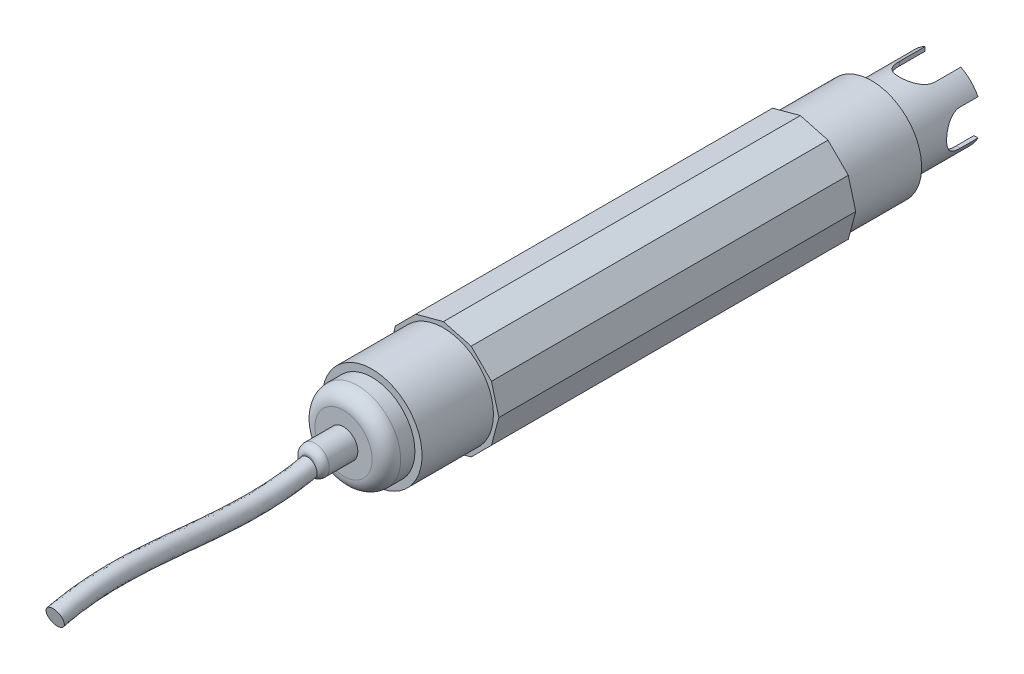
ISO-10303-21;
HEADER;
FILE_DESCRIPTION(('STEP AP214'),'2;1');
FILE_NAME('part.step','',(''),(''),'','','');
FILE_SCHEMA(('AUTOMOTIVE_DESIGN { 1 0 10303 214 1 1 1 1 }'));
ENDSEC;
DATA;
#1=APPLICATION_CONTEXT('core data for automotive mechanical design processes');
#2=APPLICATION_PROTOCOL_DEFINITION('international standard','automotive_design',2000,#1);
#3=PRODUCT_CONTEXT('',#1,'mechanical');
#4=PRODUCT('Part','Part','',(#3));
#5=PRODUCT_RELATED_PRODUCT_CATEGORY('part','',(#4));
#6=PRODUCT_DEFINITION_FORMATION('','',#4);
#7=PRODUCT_DEFINITION_CONTEXT('part definition',#1,'design');
#8=PRODUCT_DEFINITION('design','',#6,#7);
#9=PRODUCT_DEFINITION_SHAPE('','',#8);
#10=(LENGTH_UNIT() NAMED_UNIT(*) SI_UNIT(.MILLI.,.METRE.));
#11=(NAMED_UNIT(*) PLANE_ANGLE_UNIT() SI_UNIT($,.RADIAN.));
#12=(NAMED_UNIT(*) SI_UNIT($,.STERADIAN.) SOLID_ANGLE_UNIT());
#13=UNCERTAINTY_MEASURE_WITH_UNIT(LENGTH_MEASURE(1.E-05),#10,'distance_accuracy_value','');
#14=(GEOMETRIC_REPRESENTATION_CONTEXT(3) GLOBAL_UNCERTAINTY_ASSIGNED_CONTEXT((#13)) GLOBAL_UNIT_ASSIGNED_CONTEXT((#10,
#11,#12)) REPRESENTATION_CONTEXT('',''));
#15=CARTESIAN_POINT('',(0.,0.,0.));
#16=DIRECTION('',(0.,0.,1.));
#17=DIRECTION('',(1.,0.,0.));
#18=AXIS2_PLACEMENT_3D('',#15,#16,#17);
#19=CARTESIAN_POINT('',(0.,0.,-140.));
#20=DIRECTION('',(0.,0.,1.));
#21=DIRECTION('',(1.,0.,0.));
#22=AXIS2_PLACEMENT_3D('',#19,#20,#21);
#23=CYLINDRICAL_SURFACE('',#22,10.);
#24=CARTESIAN_POINT('',(0.,0.,-128.));
#25=DIRECTION('',(0.,0.,-1.));
#26=DIRECTION('',(-1.,0.,0.));
#27=AXIS2_PLACEMENT_3D('',#24,#25,#26);
#28=CIRCLE('',#27,10.);
#29=CARTESIAN_POINT('',(1.54341878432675,9.88017502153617,-128.));
#30=VERTEX_POINT('',#29);
#31=CARTESIAN_POINT('',(1.54341878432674,-9.88017502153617,-128.));
#32=VERTEX_POINT('',#31);
#33=EDGE_CURVE('E1076',#30,#32,#28,.T.);
#34=ORIENTED_EDGE('',*,*,#33,.F.);
#35=CARTESIAN_POINT('',(5.,8.66025403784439,-132.755823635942));
#36=CARTESIAN_POINT('',(5.00002361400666,8.66021552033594,-132.624878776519));
#37=CARTESIAN_POINT('',(4.9948568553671,8.66322292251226,-132.493955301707));
#38=CARTESIAN_POINT('',(4.97432835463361,8.67503956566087,-132.233251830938));
#39=CARTESIAN_POINT('',(4.95897287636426,8.68384524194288,-132.103471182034));
#40=CARTESIAN_POINT('',(4.91836897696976,8.70690282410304,-131.846728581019));
#41=CARTESIAN_POINT('',(4.89317776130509,8.72112322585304,-131.719754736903));
#42=CARTESIAN_POINT('',(4.83323443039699,8.75448565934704,-131.468768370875));
#43=CARTESIAN_POINT('',(4.79848121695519,8.77362825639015,-131.344756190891));
#44=CARTESIAN_POINT('',(4.68059421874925,8.83742418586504,-130.978895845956));
#45=CARTESIAN_POINT('',(4.58370758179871,8.888521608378,-130.742447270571));
#46=CARTESIAN_POINT('',(4.35652191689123,9.00204283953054,-130.288988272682));
#47=CARTESIAN_POINT('',(4.22617111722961,9.06448415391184,-130.072008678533));
#48=CARTESIAN_POINT('',(3.92332753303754,9.19984832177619,-129.644287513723));
#49=CARTESIAN_POINT('',(3.74825998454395,9.27321075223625,-129.435507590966));
#50=CARTESIAN_POINT('',(3.36618253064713,9.41862456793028,-129.048714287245));
#51=CARTESIAN_POINT('',(3.15916398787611,9.49067559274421,-128.870709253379));
#52=CARTESIAN_POINT('',(2.82033262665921,9.59484425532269,-128.624597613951));
#53=CARTESIAN_POINT('',(2.69838307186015,9.62993521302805,-128.543911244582));
#54=CARTESIAN_POINT('',(2.44722349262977,9.6968010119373,-128.393196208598));
#55=CARTESIAN_POINT('',(2.31801637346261,9.72857716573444,-128.323163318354));
#56=CARTESIAN_POINT('',(2.05317650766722,9.78789466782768,-128.194448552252));
#57=CARTESIAN_POINT('',(1.91754538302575,9.8154370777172,-128.135763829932));
#58=CARTESIAN_POINT('',(1.64079804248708,9.86547225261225,-128.030392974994));
#59=CARTESIAN_POINT('',(1.4996824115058,9.88796555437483,-127.983705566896));
#60=CARTESIAN_POINT('',(1.22330545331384,9.92580345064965,-127.905808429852));
#61=CARTESIAN_POINT('',(1.08834157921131,9.94154270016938,-127.873734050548));
#62=CARTESIAN_POINT('',(0.815713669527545,9.96761533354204,-127.820857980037));
#63=CARTESIAN_POINT('',(0.678049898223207,9.97794924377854,-127.80005519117));
#64=CARTESIAN_POINT('',(0.401222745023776,9.99290878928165,-127.770004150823));
#65=CARTESIAN_POINT('',(0.262060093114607,9.99753708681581,-127.760750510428));
#66=CARTESIAN_POINT('',(-0.0166197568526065,10.0009568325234,-127.753909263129));
#67=CARTESIAN_POINT('',(-0.156136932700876,9.99974863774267,-127.756320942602));
#68=CARTESIAN_POINT('',(-0.422159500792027,9.99189259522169,-127.772054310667));
#69=CARTESIAN_POINT('',(-0.54873798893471,9.98572860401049,-127.78440564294));
#70=CARTESIAN_POINT('',(-0.800317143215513,9.96872078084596,-127.818656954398));
#71=CARTESIAN_POINT('',(-0.925317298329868,9.95787547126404,-127.840559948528));
#72=CARTESIAN_POINT('',(-1.17280949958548,9.93176665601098,-127.893671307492));
#73=CARTESIAN_POINT('',(-1.29530241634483,9.91650471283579,-127.924876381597));
#74=CARTESIAN_POINT('',(-1.53706975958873,9.88192118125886,-127.996272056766));
#75=CARTESIAN_POINT('',(-1.65634293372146,9.86259803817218,-128.036466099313));
#76=CARTESIAN_POINT('',(-2.01140164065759,9.79859254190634,-128.171197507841));
#77=CARTESIAN_POINT('',(-2.24122379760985,9.74822697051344,-128.27919099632));
#78=CARTESIAN_POINT('',(-2.6799208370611,9.63687905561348,-128.527151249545));
#79=CARTESIAN_POINT('',(-2.88878786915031,9.57589275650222,-128.667129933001));
#80=CARTESIAN_POINT('',(-3.30083676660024,9.44222809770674,-128.990276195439));
#81=CARTESIAN_POINT('',(-3.50161847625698,9.36898946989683,-129.176274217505));
#82=CARTESIAN_POINT('',(-3.8705258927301,9.22271533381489,-129.578784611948));
#83=CARTESIAN_POINT('',(-4.03862220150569,9.14968006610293,-129.7953241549));
#84=CARTESIAN_POINT('',(-4.26800936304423,9.04388357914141,-130.147102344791));
#85=CARTESIAN_POINT('',(-4.34250455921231,9.00825027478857,-130.273050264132));
#86=CARTESIAN_POINT('',(-4.48048286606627,8.94042357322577,-130.531698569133));
#87=CARTESIAN_POINT('',(-4.54397081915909,8.90822866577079,-130.664395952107));
#88=CARTESIAN_POINT('',(-4.65920157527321,8.84850577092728,-130.935523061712));
#89=CARTESIAN_POINT('',(-4.7109655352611,8.82096939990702,-131.073941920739));
#90=CARTESIAN_POINT('',(-4.80224062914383,8.77161166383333,-131.355675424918));
#91=CARTESIAN_POINT('',(-4.84175707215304,8.74978782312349,-131.498987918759));
#92=CARTESIAN_POINT('',(-4.91615453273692,8.70825525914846,-131.825312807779));
#93=CARTESIAN_POINT('',(-4.94749058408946,8.69039463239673,-132.009401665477));
#94=CARTESIAN_POINT('',(-4.97893750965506,8.67238767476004,-132.287893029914));
#95=CARTESIAN_POINT('',(-4.98682704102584,8.66784921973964,-132.3812144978));
#96=CARTESIAN_POINT('',(-4.99736013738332,8.66177877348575,-132.568288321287));
#97=CARTESIAN_POINT('',(-5.00000155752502,8.66024801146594,-132.66204083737));
#98=CARTESIAN_POINT('',(-5.,8.66025403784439,-132.755823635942));
#99=B_SPLINE_CURVE_WITH_KNOTS('',3,(#35,#36,#37,#38,#39,#40,#41,#42,#43,#44,#45,#46,#47,#48,#49,
#50,#51,#52,#53,#54,#55,#56,#57,#58,#59,#60,#61,#62,#63,#64,#65,#66,#67,#68,#69,#70,#71,#72,#73,
#74,#75,#76,#77,#78,#79,#80,#81,#82,#83,#84,#85,#86,#87,#88,#89,#90,#91,#92,#93,#94,#95,#96,#97,
#98),.UNSPECIFIED.,.F.,.F.,(4,2,2,2,2,2,2,2,2,2,2,2,2,2,2,2,2,2,2,2,2,2,2,2,2,2,2,2,2,2,2,4),
(0.,0.39266311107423,0.785085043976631,1.1752578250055,1.56547543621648,2.34356953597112,
3.12287474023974,3.96591805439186,4.80918967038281,5.25982775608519,5.71028671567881,
6.16063253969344,6.61093046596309,7.02920191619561,7.4474326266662,7.86546811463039,
8.28347802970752,8.66501292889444,9.04666834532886,9.42818890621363,9.80985578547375,
10.5829611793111,11.3563551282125,12.2027949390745,13.0499925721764,13.5013153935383,
13.952439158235,14.4027422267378,14.8528498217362,15.4139318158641,15.695056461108,
15.9762959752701),.UNSPECIFIED.);
#100=CARTESIAN_POINT('',(5.,8.66025403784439,-132.755823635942));
#101=VERTEX_POINT('',#100);
#102=EDGE_CURVE('E658',#101,#30,#99,.T.);
#103=ORIENTED_EDGE('',*,*,#102,.F.);
#104=DIRECTION('',(0.,0.,1.));
#105=VECTOR('',#104,1.);
#106=CARTESIAN_POINT('',(5.,8.66025403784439,-140.));
#107=LINE('',#106,#105);
#108=CARTESIAN_POINT('',(5.,8.66025403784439,-140.));
#109=VERTEX_POINT('',#108);
#110=EDGE_CURVE('E690',#109,#101,#107,.T.);
#111=ORIENTED_EDGE('',*,*,#110,.F.);
#112=CARTESIAN_POINT('',(0.,0.,-140.));
#113=DIRECTION('',(0.,0.,-1.));
#114=DIRECTION('',(-1.,0.,0.));
#115=AXIS2_PLACEMENT_3D('',#112,#113,#114);
#116=CIRCLE('',#115,10.);
#117=CARTESIAN_POINT('',(8.66025403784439,4.99999999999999,-140.));
#118=VERTEX_POINT('',#117);
#119=EDGE_CURVE('E442',#109,#118,#116,.T.);
#120=ORIENTED_EDGE('',*,*,#119,.T.);
#121=DIRECTION('',(0.,0.,1.));
#122=VECTOR('',#121,1.);
#123=CARTESIAN_POINT('',(8.66025403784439,4.99999999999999,-140.));
#124=LINE('',#123,#122);
#125=CARTESIAN_POINT('',(8.66025403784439,4.99999999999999,-135.));
#126=VERTEX_POINT('',#125);
#127=EDGE_CURVE('E387',#126,#118,#124,.F.);
#128=ORIENTED_EDGE('',*,*,#127,.F.);
#129=CARTESIAN_POINT('',(8.66025403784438,-5.00000000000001,-135.));
#130=CARTESIAN_POINT('',(8.66021552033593,-5.00002361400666,-134.869055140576));
#131=CARTESIAN_POINT('',(8.66322292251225,-4.99485685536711,-134.738131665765));
#132=CARTESIAN_POINT('',(8.67503956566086,-4.97432835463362,-134.477428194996));
#133=CARTESIAN_POINT('',(8.68384524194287,-4.95897287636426,-134.347647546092));
#134=CARTESIAN_POINT('',(8.70690282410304,-4.91836897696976,-134.090904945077));
#135=CARTESIAN_POINT('',(8.72112322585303,-4.8931777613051,-133.963931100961));
#136=CARTESIAN_POINT('',(8.75448565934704,-4.833234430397,-133.712944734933));
#137=CARTESIAN_POINT('',(8.77362825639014,-4.79848121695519,-133.588932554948));
#138=CARTESIAN_POINT('',(8.83742418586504,-4.68059421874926,-133.223072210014));
#139=CARTESIAN_POINT('',(8.888521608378,-4.58370758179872,-132.986623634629));
#140=CARTESIAN_POINT('',(9.00204283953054,-4.35652191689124,-132.53316463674));
#141=CARTESIAN_POINT('',(9.06448415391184,-4.22617111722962,-132.31618504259));
#142=CARTESIAN_POINT('',(9.19984832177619,-3.92332753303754,-131.888463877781));
#143=CARTESIAN_POINT('',(9.27321075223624,-3.74825998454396,-131.679683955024));
#144=CARTESIAN_POINT('',(9.41862456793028,-3.36618253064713,-131.292890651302));
#145=CARTESIAN_POINT('',(9.49067559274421,-3.15916398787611,-131.114885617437));
#146=CARTESIAN_POINT('',(9.59484425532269,-2.82033262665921,-130.868773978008));
#147=CARTESIAN_POINT('',(9.62993521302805,-2.69838307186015,-130.78808760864));
#148=CARTESIAN_POINT('',(9.6968010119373,-2.44722349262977,-130.637372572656));
#149=CARTESIAN_POINT('',(9.72857716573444,-2.31801637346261,-130.567339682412));
#150=CARTESIAN_POINT('',(9.78789466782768,-2.05317650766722,-130.438624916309));
#151=CARTESIAN_POINT('',(9.81543707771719,-1.91754538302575,-130.37994019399));
#152=CARTESIAN_POINT('',(9.86547225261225,-1.64079804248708,-130.274569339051));
#153=CARTESIAN_POINT('',(9.88796555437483,-1.4996824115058,-130.227881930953));
#154=CARTESIAN_POINT('',(9.92580345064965,-1.22330545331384,-130.14998479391));
#155=CARTESIAN_POINT('',(9.94154270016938,-1.08834157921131,-130.117910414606));
#156=CARTESIAN_POINT('',(9.96761533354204,-0.815713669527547,-130.065034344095));
#157=CARTESIAN_POINT('',(9.97794924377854,-0.678049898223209,-130.044231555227));
#158=CARTESIAN_POINT('',(9.99290878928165,-0.401222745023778,-130.014180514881));
#159=CARTESIAN_POINT('',(9.99753708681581,-0.262060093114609,-130.004926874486));
#160=CARTESIAN_POINT('',(10.0009568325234,0.0166197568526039,-129.998085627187));
#161=CARTESIAN_POINT('',(9.99974863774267,0.156136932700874,-130.00049730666));
#162=CARTESIAN_POINT('',(9.99189259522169,0.422159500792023,-130.016230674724));
#163=CARTESIAN_POINT('',(9.9857286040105,0.548737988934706,-130.028582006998));
#164=CARTESIAN_POINT('',(9.96872078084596,0.800317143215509,-130.062833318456));
#165=CARTESIAN_POINT('',(9.95787547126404,0.925317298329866,-130.084736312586));
#166=CARTESIAN_POINT('',(9.93176665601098,1.17280949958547,-130.13784767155));
#167=CARTESIAN_POINT('',(9.91650471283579,1.29530241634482,-130.169052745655));
#168=CARTESIAN_POINT('',(9.88192118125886,1.53706975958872,-130.240448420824));
#169=CARTESIAN_POINT('',(9.86259803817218,1.65634293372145,-130.280642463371));
#170=CARTESIAN_POINT('',(9.79859254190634,2.01140164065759,-130.415373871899));
#171=CARTESIAN_POINT('',(9.74822697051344,2.24122379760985,-130.523367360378));
#172=CARTESIAN_POINT('',(9.63687905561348,2.6799208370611,-130.771327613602));
#173=CARTESIAN_POINT('',(9.57589275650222,2.88878786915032,-130.911306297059));
#174=CARTESIAN_POINT('',(9.44222809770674,3.30083676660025,-131.234452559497));
#175=CARTESIAN_POINT('',(9.36898946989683,3.50161847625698,-131.420450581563));
#176=CARTESIAN_POINT('',(9.22271533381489,3.87052589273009,-131.822960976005));
#177=CARTESIAN_POINT('',(9.14968006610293,4.03862220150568,-132.039500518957));
#178=CARTESIAN_POINT('',(9.04388357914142,4.26800936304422,-132.391278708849));
#179=CARTESIAN_POINT('',(9.00825027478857,4.3425045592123,-132.51722662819));
#180=CARTESIAN_POINT('',(8.94042357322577,4.48048286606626,-132.775874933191));
#181=CARTESIAN_POINT('',(8.9082286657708,4.54397081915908,-132.908572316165));
#182=CARTESIAN_POINT('',(8.84850577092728,4.65920157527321,-133.179699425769));
#183=CARTESIAN_POINT('',(8.82096939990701,4.71096553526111,-133.318118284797));
#184=CARTESIAN_POINT('',(8.77161166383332,4.80224062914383,-133.599851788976));
#185=CARTESIAN_POINT('',(8.74978782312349,4.84175707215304,-133.743164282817));
#186=CARTESIAN_POINT('',(8.70825525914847,4.91615453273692,-134.069489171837));
#187=CARTESIAN_POINT('',(8.69039463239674,4.94749058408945,-134.253578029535));
#188=CARTESIAN_POINT('',(8.67238767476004,4.97893750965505,-134.532069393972));
#189=CARTESIAN_POINT('',(8.66784921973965,4.98682704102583,-134.625390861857));
#190=CARTESIAN_POINT('',(8.66177877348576,4.99736013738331,-134.812464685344));
#191=CARTESIAN_POINT('',(8.66024801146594,5.00000155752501,-134.906217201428));
#192=CARTESIAN_POINT('',(8.66025403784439,4.99999999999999,-135.));
#193=B_SPLINE_CURVE_WITH_KNOTS('',3,(#129,#130,#131,#132,#133,#134,#135,#136,#137,#138,#139,
#140,#141,#142,#143,#144,#145,#146,#147,#148,#149,#150,#151,#152,#153,#154,#155,#156,#157,#158,
#159,#160,#161,#162,#163,#164,#165,#166,#167,#168,#169,#170,#171,#172,#173,#174,#175,#176,#177,
#178,#179,#180,#181,#182,#183,#184,#185,#186,#187,#188,#189,#190,#191,#192),.UNSPECIFIED.,.F.,
.F.,(4,2,2,2,2,2,2,2,2,2,2,2,2,2,2,2,2,2,2,2,2,2,2,2,2,2,2,2,2,2,2,4),(0.,0.39266311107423,
0.785085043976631,1.1752578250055,1.56547543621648,2.34356953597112,3.12287474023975,
3.96591805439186,4.80918967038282,5.25982775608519,5.71028671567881,6.16063253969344,
6.61093046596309,7.02920191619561,7.4474326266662,7.86546811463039,8.28347802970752,
8.66501292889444,9.04666834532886,9.42818890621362,9.80985578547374,10.5829611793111,
11.3563551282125,12.2027949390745,13.0499925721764,13.5013153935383,13.952439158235,
14.4027422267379,14.8528498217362,15.4139318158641,15.695056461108,15.9762959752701),.UNSPECIFIED.);
#194=CARTESIAN_POINT('',(8.66025403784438,-5.00000000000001,-135.));
#195=VERTEX_POINT('',#194);
#196=EDGE_CURVE('E352',#195,#126,#193,.T.);
#197=ORIENTED_EDGE('',*,*,#196,.F.);
#198=DIRECTION('',(0.,0.,1.));
#199=VECTOR('',#198,1.);
#200=CARTESIAN_POINT('',(8.66025403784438,-5.00000000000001,-140.));
#201=LINE('',#200,#199);
#202=CARTESIAN_POINT('',(8.66025403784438,-5.00000000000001,-140.));
#203=VERTEX_POINT('',#202);
#204=EDGE_CURVE('E359',#203,#195,#201,.T.);
#205=ORIENTED_EDGE('',*,*,#204,.F.);
#206=CARTESIAN_POINT('',(5.,-8.66025403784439,-140.));
#207=VERTEX_POINT('',#206);
#208=EDGE_CURVE('E443',#203,#207,#116,.T.);
#209=ORIENTED_EDGE('',*,*,#208,.T.);
#210=DIRECTION('',(0.,0.,1.));
#211=VECTOR('',#210,1.);
#212=CARTESIAN_POINT('',(5.,-8.66025403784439,-140.));
#213=LINE('',#212,#211);
#214=CARTESIAN_POINT('',(5.,-8.66025403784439,-132.755823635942));
#215=VERTEX_POINT('',#214);
#216=EDGE_CURVE('E333',#207,#215,#213,.T.);
#217=ORIENTED_EDGE('',*,*,#216,.T.);
#218=CARTESIAN_POINT('',(5.,-8.66025403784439,-132.755823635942));
#219=CARTESIAN_POINT('',(5.00002361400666,-8.66021552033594,-132.624878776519));
#220=CARTESIAN_POINT('',(4.9948568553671,-8.66322292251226,-132.493955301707));
#221=CARTESIAN_POINT('',(4.97432835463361,-8.67503956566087,-132.233251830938));
#222=CARTESIAN_POINT('',(4.95897287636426,-8.68384524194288,-132.103471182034));
#223=CARTESIAN_POINT('',(4.91836897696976,-8.70690282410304,-131.846728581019));
#224=CARTESIAN_POINT('',(4.89317776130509,-8.72112322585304,-131.719754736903));
#225=CARTESIAN_POINT('',(4.83323443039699,-8.75448565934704,-131.468768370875));
#226=CARTESIAN_POINT('',(4.79848121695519,-8.77362825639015,-131.344756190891));
#227=CARTESIAN_POINT('',(4.68059421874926,-8.83742418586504,-130.978895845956));
#228=CARTESIAN_POINT('',(4.58370758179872,-8.888521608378,-130.742447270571));
#229=CARTESIAN_POINT('',(4.35652191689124,-9.00204283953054,-130.288988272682));
#230=CARTESIAN_POINT('',(4.22617111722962,-9.06448415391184,-130.072008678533));
#231=CARTESIAN_POINT('',(3.92332753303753,-9.19984832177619,-129.644287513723));
#232=CARTESIAN_POINT('',(3.74825998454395,-9.27321075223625,-129.435507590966));
#233=CARTESIAN_POINT('',(3.36618253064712,-9.41862456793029,-129.048714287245));
#234=CARTESIAN_POINT('',(3.1591639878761,-9.49067559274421,-128.870709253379));
#235=CARTESIAN_POINT('',(2.8203326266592,-9.59484425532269,-128.624597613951));
#236=CARTESIAN_POINT('',(2.69838307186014,-9.62993521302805,-128.543911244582));
#237=CARTESIAN_POINT('',(2.44722349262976,-9.6968010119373,-128.393196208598));
#238=CARTESIAN_POINT('',(2.3180163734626,-9.72857716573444,-128.323163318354));
#239=CARTESIAN_POINT('',(2.05317650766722,-9.78789466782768,-128.194448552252));
#240=CARTESIAN_POINT('',(1.91754538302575,-9.8154370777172,-128.135763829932));
#241=CARTESIAN_POINT('',(1.64079804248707,-9.86547225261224,-128.030392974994));
#242=CARTESIAN_POINT('',(1.4996824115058,-9.88796555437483,-127.983705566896));
#243=CARTESIAN_POINT('',(1.22330545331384,-9.92580345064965,-127.905808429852));
#244=CARTESIAN_POINT('',(1.0883415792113,-9.94154270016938,-127.873734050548));
#245=CARTESIAN_POINT('',(0.815713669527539,-9.96761533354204,-127.820857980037));
#246=CARTESIAN_POINT('',(0.678049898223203,-9.97794924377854,-127.80005519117));
#247=CARTESIAN_POINT('',(0.401222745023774,-9.99290878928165,-127.770004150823));
#248=CARTESIAN_POINT('',(0.262060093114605,-9.99753708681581,-127.760750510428));
#249=CARTESIAN_POINT('',(-0.0166197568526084,-10.0009568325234,-127.753909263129));
#250=CARTESIAN_POINT('',(-0.156136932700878,-9.99974863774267,-127.756320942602));
#251=CARTESIAN_POINT('',(-0.422159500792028,-9.99189259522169,-127.772054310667));
#252=CARTESIAN_POINT('',(-0.548737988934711,-9.98572860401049,-127.78440564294));
#253=CARTESIAN_POINT('',(-0.800317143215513,-9.96872078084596,-127.818656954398));
#254=CARTESIAN_POINT('',(-0.925317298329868,-9.95787547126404,-127.840559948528));
#255=CARTESIAN_POINT('',(-1.17280949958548,-9.93176665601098,-127.893671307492));
#256=CARTESIAN_POINT('',(-1.29530241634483,-9.91650471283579,-127.924876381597));
#257=CARTESIAN_POINT('',(-1.53706975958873,-9.88192118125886,-127.996272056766));
#258=CARTESIAN_POINT('',(-1.65634293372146,-9.86259803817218,-128.036466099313));
#259=CARTESIAN_POINT('',(-2.01140164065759,-9.79859254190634,-128.171197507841));
#260=CARTESIAN_POINT('',(-2.24122379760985,-9.74822697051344,-128.27919099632));
#261=CARTESIAN_POINT('',(-2.6799208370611,-9.63687905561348,-128.527151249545));
#262=CARTESIAN_POINT('',(-2.88878786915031,-9.57589275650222,-128.667129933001));
#263=CARTESIAN_POINT('',(-3.30083676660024,-9.44222809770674,-128.990276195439));
#264=CARTESIAN_POINT('',(-3.50161847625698,-9.36898946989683,-129.176274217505));
#265=CARTESIAN_POINT('',(-3.8705258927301,-9.22271533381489,-129.578784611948));
#266=CARTESIAN_POINT('',(-4.03862220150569,-9.14968006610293,-129.7953241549));
#267=CARTESIAN_POINT('',(-4.26800936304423,-9.04388357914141,-130.147102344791));
#268=CARTESIAN_POINT('',(-4.34250455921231,-9.00825027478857,-130.273050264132));
#269=CARTESIAN_POINT('',(-4.48048286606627,-8.94042357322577,-130.531698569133));
#270=CARTESIAN_POINT('',(-4.54397081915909,-8.90822866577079,-130.664395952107));
#271=CARTESIAN_POINT('',(-4.65920157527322,-8.84850577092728,-130.935523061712));
#272=CARTESIAN_POINT('',(-4.71096553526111,-8.82096939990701,-131.073941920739));
#273=CARTESIAN_POINT('',(-4.80224062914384,-8.77161166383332,-131.355675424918));
#274=CARTESIAN_POINT('',(-4.84175707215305,-8.74978782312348,-131.498987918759));
#275=CARTESIAN_POINT('',(-4.91615453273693,-8.70825525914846,-131.825312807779));
#276=CARTESIAN_POINT('',(-4.94749058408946,-8.69039463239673,-132.009401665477));
#277=CARTESIAN_POINT('',(-4.97893750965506,-8.67238767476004,-132.287893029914));
#278=CARTESIAN_POINT('',(-4.98682704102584,-8.66784921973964,-132.3812144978));
#279=CARTESIAN_POINT('',(-4.99736013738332,-8.66177877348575,-132.568288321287));
#280=CARTESIAN_POINT('',(-5.00000155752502,-8.66024801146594,-132.66204083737));
#281=CARTESIAN_POINT('',(-5.,-8.66025403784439,-132.755823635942));
#282=B_SPLINE_CURVE_WITH_KNOTS('',3,(#218,#219,#220,#221,#222,#223,#224,#225,#226,#227,#228,
#229,#230,#231,#232,#233,#234,#235,#236,#237,#238,#239,#240,#241,#242,#243,#244,#245,#246,#247,
#248,#249,#250,#251,#252,#253,#254,#255,#256,#257,#258,#259,#260,#261,#262,#263,#264,#265,#266,
#267,#268,#269,#270,#271,#272,#273,#274,#275,#276,#277,#278,#279,#280,#281),.UNSPECIFIED.,.F.,
.F.,(4,2,2,2,2,2,2,2,2,2,2,2,2,2,2,2,2,2,2,2,2,2,2,2,2,2,2,2,2,2,2,4),(0.,0.39266311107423,
0.785085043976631,1.1752578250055,1.56547543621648,2.34356953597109,3.12287474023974,
3.96591805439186,4.80918967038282,5.25982775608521,5.71028671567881,6.16063253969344,
6.61093046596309,7.02920191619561,7.4474326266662,7.86546811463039,8.28347802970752,
8.66501292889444,9.04666834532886,9.42818890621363,9.80985578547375,10.5829611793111,
11.3563551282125,12.2027949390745,13.0499925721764,13.5013153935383,13.952439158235,
14.4027422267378,14.8528498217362,15.4139318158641,15.695056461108,15.9762959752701),.UNSPECIFIED.);
#283=EDGE_CURVE('E320',#215,#32,#282,.T.);
#284=ORIENTED_EDGE('',*,*,#283,.T.);
#285=EDGE_LOOP('',(#34,#103,#111,#120,#128,#197,#205,#209,#217,#284));
#286=FACE_BOUND('',#285,.T.);
#287=ADVANCED_FACE('F41',(#286),#23,.F.);
#288=CARTESIAN_POINT('',(0.,0.,-140.));
#289=DIRECTION('',(0.,0.,-1.));
#290=DIRECTION('',(-1.,0.,0.));
#291=AXIS2_PLACEMENT_3D('',#288,#289,#290);
#292=PLANE('',#291);
#293=DIRECTION('',(0.,1.,0.));
#294=VECTOR('',#293,1.);
#295=CARTESIAN_POINT('',(5.,-15.5301427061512,-140.));
#296=LINE('',#295,#294);
#297=CARTESIAN_POINT('',(5.,-9.79795897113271,-140.));
#298=VERTEX_POINT('',#297);
#299=EDGE_CURVE('E335',#298,#207,#296,.T.);
#300=ORIENTED_EDGE('',*,*,#299,.T.);
#301=ORIENTED_EDGE('',*,*,#208,.F.);
#302=DIRECTION('',(-1.,0.,0.));
#303=VECTOR('',#302,1.);
#304=CARTESIAN_POINT('',(15.5301427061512,-5.00000000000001,-140.));
#305=LINE('',#304,#303);
#306=CARTESIAN_POINT('',(9.79795897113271,-5.00000000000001,-140.));
#307=VERTEX_POINT('',#306);
#308=EDGE_CURVE('E380',#307,#203,#305,.T.);
#309=ORIENTED_EDGE('',*,*,#308,.F.);
#310=CARTESIAN_POINT('',(0.,0.,-140.));
#311=DIRECTION('',(0.,0.,-1.));
#312=DIRECTION('',(-1.,0.,0.));
#313=AXIS2_PLACEMENT_3D('',#310,#311,#312);
#314=CIRCLE('',#313,11.);
#315=EDGE_CURVE('E450',#307,#298,#314,.T.);
#316=ORIENTED_EDGE('',*,*,#315,.T.);
#317=EDGE_LOOP('',(#300,#301,#309,#316));
#318=FACE_BOUND('',#317,.T.);
#319=ADVANCED_FACE('F584',(#318),#292,.T.);
#320=ORIENTED_EDGE('',*,*,#119,.F.);
#321=DIRECTION('',(0.,-1.,0.));
#322=VECTOR('',#321,1.);
#323=CARTESIAN_POINT('',(5.,15.5301427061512,-140.));
#324=LINE('',#323,#322);
#325=CARTESIAN_POINT('',(5.,9.79795897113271,-140.));
#326=VERTEX_POINT('',#325);
#327=EDGE_CURVE('E688',#326,#109,#324,.T.);
#328=ORIENTED_EDGE('',*,*,#327,.F.);
#329=CARTESIAN_POINT('',(9.79795897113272,4.99999999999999,-140.));
#330=VERTEX_POINT('',#329);
#331=EDGE_CURVE('E448',#326,#330,#314,.T.);
#332=ORIENTED_EDGE('',*,*,#331,.T.);
#333=DIRECTION('',(1.,0.,0.));
#334=VECTOR('',#333,1.);
#335=CARTESIAN_POINT('',(15.5301427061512,4.99999999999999,-140.));
#336=LINE('',#335,#334);
#337=EDGE_CURVE('E390',#118,#330,#336,.T.);
#338=ORIENTED_EDGE('',*,*,#337,.F.);
#339=EDGE_LOOP('',(#320,#328,#332,#338));
#340=FACE_BOUND('',#339,.T.);
#341=ADVANCED_FACE('F590',(#340),#292,.T.);
#342=CARTESIAN_POINT('',(-9.79795897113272,4.99999999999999,-140.));
#343=VERTEX_POINT('',#342);
#344=CARTESIAN_POINT('',(-5.,9.79795897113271,-140.));
#345=VERTEX_POINT('',#344);
#346=EDGE_CURVE('E444',#343,#345,#314,.T.);
#347=ORIENTED_EDGE('',*,*,#346,.T.);
#348=DIRECTION('',(0.,1.,0.));
#349=VECTOR('',#348,1.);
#350=CARTESIAN_POINT('',(-5.,15.5301427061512,-140.));
#351=LINE('',#350,#349);
#352=CARTESIAN_POINT('',(-5.,8.66025403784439,-140.));
#353=VERTEX_POINT('',#352);
#354=EDGE_CURVE('E405',#353,#345,#351,.T.);
#355=ORIENTED_EDGE('',*,*,#354,.F.);
#356=CARTESIAN_POINT('',(-8.66025403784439,4.99999999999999,-140.));
#357=VERTEX_POINT('',#356);
#358=EDGE_CURVE('E438',#357,#353,#116,.T.);
#359=ORIENTED_EDGE('',*,*,#358,.F.);
#360=DIRECTION('',(-1.,0.,0.));
#361=VECTOR('',#360,1.);
#362=CARTESIAN_POINT('',(-15.5301427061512,4.99999999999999,-140.));
#363=LINE('',#362,#361);
#364=EDGE_CURVE('E423',#357,#343,#363,.T.);
#365=ORIENTED_EDGE('',*,*,#364,.T.);
#366=EDGE_LOOP('',(#347,#355,#359,#365));
#367=FACE_BOUND('',#366,.T.);
#368=ADVANCED_FACE('F604',(#367),#292,.T.);
#369=CARTESIAN_POINT('',(0.,0.,-140.));
#370=DIRECTION('',(0.,0.,1.));
#371=DIRECTION('',(1.,0.,0.));
#372=AXIS2_PLACEMENT_3D('',#369,#370,#371);
#373=CYLINDRICAL_SURFACE('',#372,11.);
#374=CARTESIAN_POINT('',(0.,0.,-120.));
#375=DIRECTION('',(0.,0.,-1.));
#376=DIRECTION('',(-1.,0.,0.));
#377=AXIS2_PLACEMENT_3D('',#374,#375,#376);
#378=CIRCLE('',#377,11.);
#379=CARTESIAN_POINT('',(-11.,0.,-120.));
#380=VERTEX_POINT('',#379);
#381=EDGE_CURVE('E441',#380,#380,#378,.T.);
#382=ORIENTED_EDGE('',*,*,#381,.T.);
#383=EDGE_LOOP('',(#382));
#384=FACE_BOUND('',#383,.T.);
#385=DIRECTION('',(0.,0.,1.));
#386=VECTOR('',#385,1.);
#387=CARTESIAN_POINT('',(5.,9.79795897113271,-140.));
#388=LINE('',#387,#386);
#389=CARTESIAN_POINT('',(5.,9.79795897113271,-132.755823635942));
#390=VERTEX_POINT('',#389);
#391=EDGE_CURVE('E692',#326,#390,#388,.T.);
#392=ORIENTED_EDGE('',*,*,#391,.T.);
#393=CARTESIAN_POINT('',(5.,9.79795897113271,-132.755823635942));
#394=CARTESIAN_POINT('',(5.00002295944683,9.79792508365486,-132.623148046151));
#395=CARTESIAN_POINT('',(4.99472023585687,9.80065274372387,-132.490487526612));
#396=CARTESIAN_POINT('',(4.97363802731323,9.81138012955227,-132.226280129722));
#397=CARTESIAN_POINT('',(4.95786374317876,9.81937723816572,-132.094732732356));
#398=CARTESIAN_POINT('',(4.91611440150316,9.84034188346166,-131.834335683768));
#399=CARTESIAN_POINT('',(4.8901892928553,9.85328507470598,-131.70547602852));
#400=CARTESIAN_POINT('',(4.82843846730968,9.883692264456,-131.450693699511));
#401=CARTESIAN_POINT('',(4.79261188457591,9.90115665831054,-131.324771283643));
#402=CARTESIAN_POINT('',(4.7114956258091,9.94001116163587,-131.076901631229));
#403=CARTESIAN_POINT('',(4.66622368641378,9.96139390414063,-130.954947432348));
#404=CARTESIAN_POINT('',(4.56658407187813,10.0074633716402,-130.715442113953));
#405=CARTESIAN_POINT('',(4.51221294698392,10.0321513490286,-130.597892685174));
#406=CARTESIAN_POINT('',(4.33596702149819,10.1101882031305,-130.252601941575));
#407=CARTESIAN_POINT('',(4.20098130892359,10.1674991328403,-130.032283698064));
#408=CARTESIAN_POINT('',(3.88954809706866,10.2908353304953,-129.601979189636));
#409=CARTESIAN_POINT('',(3.71093037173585,10.3571871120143,-129.39367117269));
#410=CARTESIAN_POINT('',(3.32164455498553,10.4885052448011,-129.008623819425));
#411=CARTESIAN_POINT('',(3.11096887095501,10.5534712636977,-128.831891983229));
#412=CARTESIAN_POINT('',(2.76840240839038,10.6466449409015,-128.589652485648));
#413=CARTESIAN_POINT('',(2.64633809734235,10.6777132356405,-128.511056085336));
#414=CARTESIAN_POINT('',(2.39530021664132,10.7368118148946,-128.364510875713));
#415=CARTESIAN_POINT('',(2.26632959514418,10.7648433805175,-128.296557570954));
#416=CARTESIAN_POINT('',(2.00229851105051,10.8170660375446,-128.171925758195));
#417=CARTESIAN_POINT('',(1.8672377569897,10.84125694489,-128.115247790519));
#418=CARTESIAN_POINT('',(1.59206613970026,10.8850684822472,-128.01379767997));
#419=CARTESIAN_POINT('',(1.45195796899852,10.9046915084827,-127.96901929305));
#420=CARTESIAN_POINT('',(1.17630303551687,10.9377515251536,-127.894191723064));
#421=CARTESIAN_POINT('',(1.04098865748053,10.9514895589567,-127.863418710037));
#422=CARTESIAN_POINT('',(0.767926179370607,10.9740167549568,-127.813197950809));
#423=CARTESIAN_POINT('',(0.630179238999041,10.982808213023,-127.793744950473));
#424=CARTESIAN_POINT('',(0.353335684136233,10.9951966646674,-127.766384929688));
#425=CARTESIAN_POINT('',(0.214239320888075,10.9987946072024,-127.758475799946));
#426=CARTESIAN_POINT('',(-0.0641612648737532,11.0006934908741,-127.754297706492));
#427=CARTESIAN_POINT('',(-0.203465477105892,10.998994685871,-127.758028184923));
#428=CARTESIAN_POINT('',(-0.471042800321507,10.9906651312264,-127.776388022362));
#429=CARTESIAN_POINT('',(-0.599383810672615,10.9844006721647,-127.790208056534));
#430=CARTESIAN_POINT('',(-0.85437379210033,10.967514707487,-127.827674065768));
#431=CARTESIAN_POINT('',(-0.981022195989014,10.9568917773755,-127.851323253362));
#432=CARTESIAN_POINT('',(-1.23168671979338,10.9315508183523,-127.90820018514));
#433=CARTESIAN_POINT('',(-1.35570375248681,10.9168342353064,-127.94142454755));
#434=CARTESIAN_POINT('',(-1.60038179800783,10.8836602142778,-128.017131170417));
#435=CARTESIAN_POINT('',(-1.72104151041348,10.8652013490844,-128.059616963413));
#436=CARTESIAN_POINT('',(-2.08037159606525,10.8042326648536,-128.201821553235));
#437=CARTESIAN_POINT('',(-2.31282105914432,10.756508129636,-128.315471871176));
#438=CARTESIAN_POINT('',(-2.75583700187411,10.651637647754,-128.57592566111));
#439=CARTESIAN_POINT('',(-2.96639508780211,10.5944881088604,-128.722741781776));
#440=CARTESIAN_POINT('',(-3.37805642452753,10.4708438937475,-129.059198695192));
#441=CARTESIAN_POINT('',(-3.57699205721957,10.4039671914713,-129.251353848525));
#442=CARTESIAN_POINT('',(-3.94094475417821,10.271637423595,-129.666309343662));
#443=CARTESIAN_POINT('',(-4.10593953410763,10.2061853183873,-129.889129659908));
#444=CARTESIAN_POINT('',(-4.32804759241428,10.1131037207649,-130.248020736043));
#445=CARTESIAN_POINT('',(-4.39910487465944,10.0823123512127,-130.374838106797));
#446=CARTESIAN_POINT('',(-4.53015912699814,10.0241106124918,-130.634782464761));
#447=CARTESIAN_POINT('',(-4.59016097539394,9.99669875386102,-130.767906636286));
#448=CARTESIAN_POINT('',(-4.69843290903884,9.94627052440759,-131.039415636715));
#449=CARTESIAN_POINT('',(-4.74672044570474,9.92324762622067,-131.177792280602));
#450=CARTESIAN_POINT('',(-4.83109860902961,9.8824430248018,-131.458897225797));
#451=CARTESIAN_POINT('',(-4.86719462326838,9.86465900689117,-131.601623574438));
#452=CARTESIAN_POINT('',(-4.93106703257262,9.83290680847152,-131.911394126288));
#453=CARTESIAN_POINT('',(-4.95686706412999,9.81987113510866,-132.078953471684));
#454=CARTESIAN_POINT('',(-4.98271901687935,9.80676252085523,-132.331892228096));
#455=CARTESIAN_POINT('',(-4.98919500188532,9.80346710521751,-132.416505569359));
#456=CARTESIAN_POINT('',(-4.99783601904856,9.79906363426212,-132.586013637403));
#457=CARTESIAN_POINT('',(-5.00000079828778,9.79795570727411,-132.670908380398));
#458=CARTESIAN_POINT('',(-5.,9.79795897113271,-132.755823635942));
#459=B_SPLINE_CURVE_WITH_KNOTS('',3,(#393,#394,#395,#396,#397,#398,#399,#400,#401,#402,#403,
#404,#405,#406,#407,#408,#409,#410,#411,#412,#413,#414,#415,#416,#417,#418,#419,#420,#421,#422,
#423,#424,#425,#426,#427,#428,#429,#430,#431,#432,#433,#434,#435,#436,#437,#438,#439,#440,#441,
#442,#443,#444,#445,#446,#447,#448,#449,#450,#451,#452,#453,#454,#455,#456,#457,#458),
.UNSPECIFIED.,.F.,.F.,(4,2,2,2,2,2,2,2,2,2,2,2,2,2,2,2,2,2,2,2,2,2,2,2,2,2,2,2,2,2,2,2,4),(0.,
0.397869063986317,0.795540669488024,1.19127956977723,1.58705308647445,1.98208999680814,
2.37727701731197,3.16785827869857,4.01134888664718,4.85503957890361,5.29996251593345,
5.74469701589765,6.18945282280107,6.63397479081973,7.05176458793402,7.46936031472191,
7.88687972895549,8.30437913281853,8.69162633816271,9.07900020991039,9.46623743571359,
9.85362262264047,10.6393130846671,11.4253036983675,12.2753250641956,13.1259027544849,
13.5711957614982,14.0162918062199,14.4607206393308,14.9049528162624,15.4138608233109,
15.6685164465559,15.9231870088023),.UNSPECIFIED.);
#460=CARTESIAN_POINT('',(-5.,9.79795897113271,-132.755823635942));
#461=VERTEX_POINT('',#460);
#462=EDGE_CURVE('E656',#390,#461,#459,.T.);
#463=ORIENTED_EDGE('',*,*,#462,.T.);
#464=DIRECTION('',(0.,0.,1.));
#465=VECTOR('',#464,1.);
#466=CARTESIAN_POINT('',(-5.,9.79795897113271,-140.));
#467=LINE('',#466,#465);
#468=EDGE_CURVE('E701',#461,#345,#467,.F.);
#469=ORIENTED_EDGE('',*,*,#468,.T.);
#470=ORIENTED_EDGE('',*,*,#346,.F.);
#471=DIRECTION('',(0.,0.,1.));
#472=VECTOR('',#471,1.);
#473=CARTESIAN_POINT('',(-9.79795897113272,4.99999999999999,-140.));
#474=LINE('',#473,#472);
#475=CARTESIAN_POINT('',(-9.79795897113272,4.99999999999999,-135.));
#476=VERTEX_POINT('',#475);
#477=EDGE_CURVE('E421',#476,#343,#474,.F.);
#478=ORIENTED_EDGE('',*,*,#477,.F.);
#479=CARTESIAN_POINT('',(-9.79795897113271,-5.00000000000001,-135.));
#480=CARTESIAN_POINT('',(-9.79792508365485,-5.00002295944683,-134.867324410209));
#481=CARTESIAN_POINT('',(-9.80065274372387,-4.99472023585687,-134.73466389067));
#482=CARTESIAN_POINT('',(-9.81138012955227,-4.97363802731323,-134.47045649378));
#483=CARTESIAN_POINT('',(-9.81937723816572,-4.95786374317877,-134.338909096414));
#484=CARTESIAN_POINT('',(-9.84034188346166,-4.91611440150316,-134.078512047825));
#485=CARTESIAN_POINT('',(-9.85328507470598,-4.8901892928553,-133.949652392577));
#486=CARTESIAN_POINT('',(-9.883692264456,-4.82843846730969,-133.694870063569));
#487=CARTESIAN_POINT('',(-9.90115665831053,-4.79261188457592,-133.5689476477));
#488=CARTESIAN_POINT('',(-9.94001116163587,-4.7114956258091,-133.321077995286));
#489=CARTESIAN_POINT('',(-9.96139390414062,-4.66622368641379,-133.199123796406));
#490=CARTESIAN_POINT('',(-10.0074633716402,-4.56658407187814,-132.95961847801));
#491=CARTESIAN_POINT('',(-10.0321513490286,-4.51221294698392,-132.842069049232));
#492=CARTESIAN_POINT('',(-10.1101882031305,-4.33596702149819,-132.496778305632));
#493=CARTESIAN_POINT('',(-10.1674991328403,-4.20098130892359,-132.276460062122));
#494=CARTESIAN_POINT('',(-10.2908353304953,-3.88954809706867,-131.846155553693));
#495=CARTESIAN_POINT('',(-10.3571871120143,-3.71093037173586,-131.637847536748));
#496=CARTESIAN_POINT('',(-10.4885052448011,-3.32164455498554,-131.252800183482));
#497=CARTESIAN_POINT('',(-10.5534712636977,-3.11096887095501,-131.076068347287));
#498=CARTESIAN_POINT('',(-10.6466449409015,-2.76840240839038,-130.833828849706));
#499=CARTESIAN_POINT('',(-10.6777132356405,-2.64633809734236,-130.755232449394));
#500=CARTESIAN_POINT('',(-10.7368118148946,-2.39530021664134,-130.608687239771));
#501=CARTESIAN_POINT('',(-10.7648433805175,-2.2663295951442,-130.540733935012));
#502=CARTESIAN_POINT('',(-10.8170660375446,-2.00229851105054,-130.416102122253));
#503=CARTESIAN_POINT('',(-10.84125694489,-1.86723775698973,-130.359424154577));
#504=CARTESIAN_POINT('',(-10.8850684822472,-1.59206613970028,-130.257974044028));
#505=CARTESIAN_POINT('',(-10.9046915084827,-1.45195796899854,-130.213195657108));
#506=CARTESIAN_POINT('',(-10.9377515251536,-1.17630303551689,-130.138368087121));
#507=CARTESIAN_POINT('',(-10.9514895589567,-1.04098865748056,-130.107595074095));
#508=CARTESIAN_POINT('',(-10.9740167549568,-0.76792617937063,-130.057374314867));
#509=CARTESIAN_POINT('',(-10.982808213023,-0.630179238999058,-130.037921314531));
#510=CARTESIAN_POINT('',(-10.9951966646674,-0.353335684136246,-130.010561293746));
#511=CARTESIAN_POINT('',(-10.9987946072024,-0.214239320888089,-130.002652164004));
#512=CARTESIAN_POINT('',(-11.0006934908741,0.0641612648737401,-129.99847407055));
#513=CARTESIAN_POINT('',(-10.998994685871,0.20346547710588,-130.002204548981));
#514=CARTESIAN_POINT('',(-10.9906651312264,0.471042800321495,-130.02056438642));
#515=CARTESIAN_POINT('',(-10.9844006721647,0.599383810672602,-130.034384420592));
#516=CARTESIAN_POINT('',(-10.967514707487,0.854373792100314,-130.071850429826));
#517=CARTESIAN_POINT('',(-10.9568917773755,0.981022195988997,-130.09549961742));
#518=CARTESIAN_POINT('',(-10.9315508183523,1.23168671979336,-130.152376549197));
#519=CARTESIAN_POINT('',(-10.9168342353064,1.35570375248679,-130.185600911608));
#520=CARTESIAN_POINT('',(-10.8836602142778,1.60038179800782,-130.261307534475));
#521=CARTESIAN_POINT('',(-10.8652013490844,1.72104151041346,-130.30379332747));
#522=CARTESIAN_POINT('',(-10.8042326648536,2.08037159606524,-130.445997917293));
#523=CARTESIAN_POINT('',(-10.756508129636,2.31282105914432,-130.559648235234));
#524=CARTESIAN_POINT('',(-10.651637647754,2.7558370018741,-130.820102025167));
#525=CARTESIAN_POINT('',(-10.5944881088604,2.9663950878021,-130.966918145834));
#526=CARTESIAN_POINT('',(-10.4708438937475,3.37805642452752,-131.303375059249));
#527=CARTESIAN_POINT('',(-10.4039671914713,3.57699205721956,-131.495530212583));
#528=CARTESIAN_POINT('',(-10.271637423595,3.9409447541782,-131.910485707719));
#529=CARTESIAN_POINT('',(-10.2061853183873,4.10593953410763,-132.133306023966));
#530=CARTESIAN_POINT('',(-10.1131037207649,4.32804759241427,-132.492197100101));
#531=CARTESIAN_POINT('',(-10.0823123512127,4.39910487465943,-132.619014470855));
#532=CARTESIAN_POINT('',(-10.0241106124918,4.53015912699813,-132.878958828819));
#533=CARTESIAN_POINT('',(-9.99669875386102,4.59016097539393,-133.012083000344));
#534=CARTESIAN_POINT('',(-9.9462705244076,4.69843290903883,-133.283592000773));
#535=CARTESIAN_POINT('',(-9.92324762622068,4.74672044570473,-133.42196864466));
#536=CARTESIAN_POINT('',(-9.88244302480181,4.8310986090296,-133.703073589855));
#537=CARTESIAN_POINT('',(-9.86465900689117,4.86719462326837,-133.845799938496));
#538=CARTESIAN_POINT('',(-9.83290680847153,4.93106703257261,-134.155570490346));
#539=CARTESIAN_POINT('',(-9.81987113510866,4.95686706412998,-134.323129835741));
#540=CARTESIAN_POINT('',(-9.80676252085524,4.98271901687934,-134.576068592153));
#541=CARTESIAN_POINT('',(-9.80346710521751,4.98919500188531,-134.660681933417));
#542=CARTESIAN_POINT('',(-9.79906363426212,4.99783601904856,-134.83019000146));
#543=CARTESIAN_POINT('',(-9.79795570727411,5.00000079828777,-134.915084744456));
#544=CARTESIAN_POINT('',(-9.79795897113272,4.99999999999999,-135.));
#545=B_SPLINE_CURVE_WITH_KNOTS('',3,(#479,#480,#481,#482,#483,#484,#485,#486,#487,#488,#489,
#490,#491,#492,#493,#494,#495,#496,#497,#498,#499,#500,#501,#502,#503,#504,#505,#506,#507,#508,
#509,#510,#511,#512,#513,#514,#515,#516,#517,#518,#519,#520,#521,#522,#523,#524,#525,#526,#527,
#528,#529,#530,#531,#532,#533,#534,#535,#536,#537,#538,#539,#540,#541,#542,#543,#544),
.UNSPECIFIED.,.F.,.F.,(4,2,2,2,2,2,2,2,2,2,2,2,2,2,2,2,2,2,2,2,2,2,2,2,2,2,2,2,2,2,2,2,4),(0.,
0.397869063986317,0.795540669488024,1.19127956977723,1.58705308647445,1.98208999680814,
2.37727701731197,3.16785827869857,4.01134888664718,4.85503957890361,5.29996251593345,
5.74469701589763,6.18945282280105,6.63397479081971,7.051764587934,7.4693603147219,
7.88687972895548,8.30437913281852,8.6916263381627,9.07900020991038,9.46623743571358,
9.85362262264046,10.6393130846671,11.4253036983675,12.2753250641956,13.1259027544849,
13.5711957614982,14.0162918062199,14.4607206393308,14.9049528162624,15.4138608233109,
15.6685164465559,15.9231870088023),.UNSPECIFIED.);
#546=CARTESIAN_POINT('',(-9.79795897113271,-5.00000000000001,-135.));
#547=VERTEX_POINT('',#546);
#548=EDGE_CURVE('E416',#547,#476,#545,.T.);
#549=ORIENTED_EDGE('',*,*,#548,.F.);
#550=DIRECTION('',(0.,0.,1.));
#551=VECTOR('',#550,1.);
#552=CARTESIAN_POINT('',(-9.79795897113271,-5.00000000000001,-140.));
#553=LINE('',#552,#551);
#554=CARTESIAN_POINT('',(-9.79795897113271,-5.00000000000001,-140.));
#555=VERTEX_POINT('',#554);
#556=EDGE_CURVE('E360',#555,#547,#553,.T.);
#557=ORIENTED_EDGE('',*,*,#556,.F.);
#558=CARTESIAN_POINT('',(-5.,-9.79795897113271,-140.));
#559=VERTEX_POINT('',#558);
#560=EDGE_CURVE('E449',#559,#555,#314,.T.);
#561=ORIENTED_EDGE('',*,*,#560,.F.);
#562=DIRECTION('',(0.,0.,1.));
#563=VECTOR('',#562,1.);
#564=CARTESIAN_POINT('',(-5.,-9.79795897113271,-140.));
#565=LINE('',#564,#563);
#566=CARTESIAN_POINT('',(-5.,-9.79795897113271,-132.755823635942));
#567=VERTEX_POINT('',#566);
#568=EDGE_CURVE('E350',#567,#559,#565,.F.);
#569=ORIENTED_EDGE('',*,*,#568,.F.);
#570=CARTESIAN_POINT('',(5.,-9.79795897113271,-132.755823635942));
#571=CARTESIAN_POINT('',(5.00002295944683,-9.79792508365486,-132.623148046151));
#572=CARTESIAN_POINT('',(4.99472023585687,-9.80065274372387,-132.490487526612));
#573=CARTESIAN_POINT('',(4.97363802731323,-9.81138012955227,-132.226280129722));
#574=CARTESIAN_POINT('',(4.95786374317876,-9.81937723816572,-132.094732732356));
#575=CARTESIAN_POINT('',(4.91611440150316,-9.84034188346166,-131.834335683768));
#576=CARTESIAN_POINT('',(4.8901892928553,-9.85328507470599,-131.70547602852));
#577=CARTESIAN_POINT('',(4.82843846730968,-9.883692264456,-131.450693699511));
#578=CARTESIAN_POINT('',(4.79261188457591,-9.90115665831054,-131.324771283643));
#579=CARTESIAN_POINT('',(4.7114956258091,-9.94001116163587,-131.076901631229));
#580=CARTESIAN_POINT('',(4.66622368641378,-9.96139390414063,-130.954947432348));
#581=CARTESIAN_POINT('',(4.56658407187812,-10.0074633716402,-130.715442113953));
#582=CARTESIAN_POINT('',(4.51221294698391,-10.0321513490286,-130.597892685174));
#583=CARTESIAN_POINT('',(4.33596702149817,-10.1101882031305,-130.252601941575));
#584=CARTESIAN_POINT('',(4.20098130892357,-10.1674991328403,-130.032283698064));
#585=CARTESIAN_POINT('',(3.88954809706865,-10.2908353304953,-129.601979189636));
#586=CARTESIAN_POINT('',(3.71093037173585,-10.3571871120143,-129.39367117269));
#587=CARTESIAN_POINT('',(3.32164455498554,-10.4885052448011,-129.008623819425));
#588=CARTESIAN_POINT('',(3.11096887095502,-10.5534712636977,-128.831891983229));
#589=CARTESIAN_POINT('',(2.76840240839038,-10.6466449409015,-128.589652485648));
#590=CARTESIAN_POINT('',(2.64633809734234,-10.6777132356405,-128.511056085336));
#591=CARTESIAN_POINT('',(2.39530021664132,-10.7368118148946,-128.364510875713));
#592=CARTESIAN_POINT('',(2.26632959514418,-10.7648433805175,-128.296557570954));
#593=CARTESIAN_POINT('',(2.0022985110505,-10.8170660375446,-128.171925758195));
#594=CARTESIAN_POINT('',(1.86723775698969,-10.84125694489,-128.115247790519));
#595=CARTESIAN_POINT('',(1.59206613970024,-10.8850684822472,-128.01379767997));
#596=CARTESIAN_POINT('',(1.45195796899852,-10.9046915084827,-127.96901929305));
#597=CARTESIAN_POINT('',(1.17630303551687,-10.9377515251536,-127.894191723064));
#598=CARTESIAN_POINT('',(1.04098865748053,-10.9514895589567,-127.863418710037));
#599=CARTESIAN_POINT('',(0.767926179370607,-10.9740167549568,-127.813197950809));
#600=CARTESIAN_POINT('',(0.630179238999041,-10.982808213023,-127.793744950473));
#601=CARTESIAN_POINT('',(0.353335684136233,-10.9951966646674,-127.766384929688));
#602=CARTESIAN_POINT('',(0.214239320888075,-10.9987946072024,-127.758475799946));
#603=CARTESIAN_POINT('',(-0.064161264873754,-11.0006934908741,-127.754297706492));
#604=CARTESIAN_POINT('',(-0.203465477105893,-10.998994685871,-127.758028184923));
#605=CARTESIAN_POINT('',(-0.471042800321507,-10.9906651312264,-127.776388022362));
#606=CARTESIAN_POINT('',(-0.599383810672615,-10.9844006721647,-127.790208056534));
#607=CARTESIAN_POINT('',(-0.85437379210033,-10.967514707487,-127.827674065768));
#608=CARTESIAN_POINT('',(-0.981022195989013,-10.9568917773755,-127.851323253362));
#609=CARTESIAN_POINT('',(-1.23168671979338,-10.9315508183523,-127.90820018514));
#610=CARTESIAN_POINT('',(-1.35570375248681,-10.9168342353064,-127.94142454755));
#611=CARTESIAN_POINT('',(-1.60038179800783,-10.8836602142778,-128.017131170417));
#612=CARTESIAN_POINT('',(-1.72104151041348,-10.8652013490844,-128.059616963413));
#613=CARTESIAN_POINT('',(-2.08037159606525,-10.8042326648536,-128.201821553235));
#614=CARTESIAN_POINT('',(-2.31282105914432,-10.756508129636,-128.315471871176));
#615=CARTESIAN_POINT('',(-2.75583700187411,-10.651637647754,-128.57592566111));
#616=CARTESIAN_POINT('',(-2.96639508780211,-10.5944881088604,-128.722741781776));
#617=CARTESIAN_POINT('',(-3.37805642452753,-10.4708438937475,-129.059198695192));
#618=CARTESIAN_POINT('',(-3.57699205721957,-10.4039671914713,-129.251353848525));
#619=CARTESIAN_POINT('',(-3.94094475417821,-10.271637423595,-129.666309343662));
#620=CARTESIAN_POINT('',(-4.10593953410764,-10.2061853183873,-129.889129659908));
#621=CARTESIAN_POINT('',(-4.32804759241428,-10.1131037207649,-130.248020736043));
#622=CARTESIAN_POINT('',(-4.39910487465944,-10.0823123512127,-130.374838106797));
#623=CARTESIAN_POINT('',(-4.53015912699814,-10.0241106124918,-130.634782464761));
#624=CARTESIAN_POINT('',(-4.59016097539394,-9.99669875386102,-130.767906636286));
#625=CARTESIAN_POINT('',(-4.69843290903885,-9.94627052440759,-131.039415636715));
#626=CARTESIAN_POINT('',(-4.74672044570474,-9.92324762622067,-131.177792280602));
#627=CARTESIAN_POINT('',(-4.83109860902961,-9.8824430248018,-131.458897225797));
#628=CARTESIAN_POINT('',(-4.86719462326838,-9.86465900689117,-131.601623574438));
#629=CARTESIAN_POINT('',(-4.93106703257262,-9.83290680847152,-131.911394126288));
#630=CARTESIAN_POINT('',(-4.95686706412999,-9.81987113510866,-132.078953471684));
#631=CARTESIAN_POINT('',(-4.98271901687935,-9.80676252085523,-132.331892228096));
#632=CARTESIAN_POINT('',(-4.98919500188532,-9.80346710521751,-132.416505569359));
#633=CARTESIAN_POINT('',(-4.99783601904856,-9.79906363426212,-132.586013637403));
#634=CARTESIAN_POINT('',(-5.00000079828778,-9.79795570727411,-132.670908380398));
#635=CARTESIAN_POINT('',(-5.,-9.79795897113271,-132.755823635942));
#636=B_SPLINE_CURVE_WITH_KNOTS('',3,(#570,#571,#572,#573,#574,#575,#576,#577,#578,#579,#580,
#581,#582,#583,#584,#585,#586,#587,#588,#589,#590,#591,#592,#593,#594,#595,#596,#597,#598,#599,
#600,#601,#602,#603,#604,#605,#606,#607,#608,#609,#610,#611,#612,#613,#614,#615,#616,#617,#618,
#619,#620,#621,#622,#623,#624,#625,#626,#627,#628,#629,#630,#631,#632,#633,#634,#635),
.UNSPECIFIED.,.F.,.F.,(4,2,2,2,2,2,2,2,2,2,2,2,2,2,2,2,2,2,2,2,2,2,2,2,2,2,2,2,2,2,2,2,4),(0.,
0.397869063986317,0.795540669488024,1.19127956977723,1.58705308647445,1.98208999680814,
2.37727701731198,3.1678582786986,4.01134888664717,4.8550395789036,5.29996251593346,
5.74469701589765,6.18945282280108,6.63397479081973,7.05176458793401,7.46936031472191,
7.88687972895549,8.30437913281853,8.69162633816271,9.07900020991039,9.46623743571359,
9.85362262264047,10.6393130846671,11.4253036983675,12.2753250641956,13.1259027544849,
13.5711957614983,14.0162918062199,14.4607206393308,14.9049528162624,15.4138608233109,
15.6685164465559,15.9231870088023),.UNSPECIFIED.);
#637=CARTESIAN_POINT('',(5.,-9.79795897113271,-132.755823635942));
#638=VERTEX_POINT('',#637);
#639=EDGE_CURVE('E327',#638,#567,#636,.T.);
#640=ORIENTED_EDGE('',*,*,#639,.F.);
#641=DIRECTION('',(0.,0.,1.));
#642=VECTOR('',#641,1.);
#643=CARTESIAN_POINT('',(5.,-9.79795897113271,-140.));
#644=LINE('',#643,#642);
#645=EDGE_CURVE('E332',#298,#638,#644,.T.);
#646=ORIENTED_EDGE('',*,*,#645,.F.);
#647=ORIENTED_EDGE('',*,*,#315,.F.);
#648=DIRECTION('',(0.,0.,1.));
#649=VECTOR('',#648,1.);
#650=CARTESIAN_POINT('',(9.79795897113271,-5.00000000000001,-140.));
#651=LINE('',#650,#649);
#652=CARTESIAN_POINT('',(9.79795897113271,-5.00000000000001,-135.));
#653=VERTEX_POINT('',#652);
#654=EDGE_CURVE('E377',#307,#653,#651,.T.);
#655=ORIENTED_EDGE('',*,*,#654,.T.);
#656=CARTESIAN_POINT('',(9.79795897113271,-5.00000000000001,-135.));
#657=CARTESIAN_POINT('',(9.79792508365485,-5.00002295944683,-134.867324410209));
#658=CARTESIAN_POINT('',(9.80065274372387,-4.99472023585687,-134.73466389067));
#659=CARTESIAN_POINT('',(9.81138012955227,-4.97363802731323,-134.47045649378));
#660=CARTESIAN_POINT('',(9.81937723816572,-4.95786374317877,-134.338909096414));
#661=CARTESIAN_POINT('',(9.84034188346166,-4.91611440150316,-134.078512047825));
#662=CARTESIAN_POINT('',(9.85328507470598,-4.8901892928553,-133.949652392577));
#663=CARTESIAN_POINT('',(9.883692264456,-4.82843846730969,-133.694870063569));
#664=CARTESIAN_POINT('',(9.90115665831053,-4.79261188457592,-133.5689476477));
#665=CARTESIAN_POINT('',(9.94001116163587,-4.7114956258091,-133.321077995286));
#666=CARTESIAN_POINT('',(9.96139390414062,-4.66622368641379,-133.199123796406));
#667=CARTESIAN_POINT('',(10.0074633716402,-4.56658407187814,-132.95961847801));
#668=CARTESIAN_POINT('',(10.0321513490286,-4.51221294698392,-132.842069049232));
#669=CARTESIAN_POINT('',(10.1101882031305,-4.33596702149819,-132.496778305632));
#670=CARTESIAN_POINT('',(10.1674991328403,-4.20098130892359,-132.276460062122));
#671=CARTESIAN_POINT('',(10.2908353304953,-3.88954809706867,-131.846155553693));
#672=CARTESIAN_POINT('',(10.3571871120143,-3.71093037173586,-131.637847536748));
#673=CARTESIAN_POINT('',(10.4885052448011,-3.32164455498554,-131.252800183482));
#674=CARTESIAN_POINT('',(10.5534712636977,-3.11096887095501,-131.076068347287));
#675=CARTESIAN_POINT('',(10.6466449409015,-2.76840240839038,-130.833828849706));
#676=CARTESIAN_POINT('',(10.6777132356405,-2.64633809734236,-130.755232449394));
#677=CARTESIAN_POINT('',(10.7368118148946,-2.39530021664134,-130.608687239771));
#678=CARTESIAN_POINT('',(10.7648433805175,-2.2663295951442,-130.540733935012));
#679=CARTESIAN_POINT('',(10.8170660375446,-2.00229851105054,-130.416102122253));
#680=CARTESIAN_POINT('',(10.84125694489,-1.86723775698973,-130.359424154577));
#681=CARTESIAN_POINT('',(10.8850684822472,-1.59206613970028,-130.257974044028));
#682=CARTESIAN_POINT('',(10.9046915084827,-1.45195796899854,-130.213195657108));
#683=CARTESIAN_POINT('',(10.9377515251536,-1.17630303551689,-130.138368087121));
#684=CARTESIAN_POINT('',(10.9514895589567,-1.04098865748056,-130.107595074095));
#685=CARTESIAN_POINT('',(10.9740167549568,-0.76792617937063,-130.057374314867));
#686=CARTESIAN_POINT('',(10.982808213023,-0.630179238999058,-130.037921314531));
#687=CARTESIAN_POINT('',(10.9951966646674,-0.353335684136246,-130.010561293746));
#688=CARTESIAN_POINT('',(10.9987946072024,-0.214239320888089,-130.002652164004));
#689=CARTESIAN_POINT('',(11.0006934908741,0.0641612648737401,-129.99847407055));
#690=CARTESIAN_POINT('',(10.998994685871,0.20346547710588,-130.002204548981));
#691=CARTESIAN_POINT('',(10.9906651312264,0.471042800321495,-130.02056438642));
#692=CARTESIAN_POINT('',(10.9844006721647,0.599383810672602,-130.034384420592));
#693=CARTESIAN_POINT('',(10.967514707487,0.854373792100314,-130.071850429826));
#694=CARTESIAN_POINT('',(10.9568917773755,0.981022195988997,-130.09549961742));
#695=CARTESIAN_POINT('',(10.9315508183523,1.23168671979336,-130.152376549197));
#696=CARTESIAN_POINT('',(10.9168342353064,1.35570375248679,-130.185600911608));
#697=CARTESIAN_POINT('',(10.8836602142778,1.60038179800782,-130.261307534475));
#698=CARTESIAN_POINT('',(10.8652013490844,1.72104151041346,-130.30379332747));
#699=CARTESIAN_POINT('',(10.8042326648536,2.08037159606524,-130.445997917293));
#700=CARTESIAN_POINT('',(10.756508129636,2.31282105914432,-130.559648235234));
#701=CARTESIAN_POINT('',(10.651637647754,2.7558370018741,-130.820102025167));
#702=CARTESIAN_POINT('',(10.5944881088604,2.9663950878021,-130.966918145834));
#703=CARTESIAN_POINT('',(10.4708438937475,3.37805642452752,-131.303375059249));
#704=CARTESIAN_POINT('',(10.4039671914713,3.57699205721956,-131.495530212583));
#705=CARTESIAN_POINT('',(10.271637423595,3.9409447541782,-131.910485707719));
#706=CARTESIAN_POINT('',(10.2061853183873,4.10593953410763,-132.133306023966));
#707=CARTESIAN_POINT('',(10.1131037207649,4.32804759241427,-132.492197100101));
#708=CARTESIAN_POINT('',(10.0823123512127,4.39910487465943,-132.619014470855));
#709=CARTESIAN_POINT('',(10.0241106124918,4.53015912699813,-132.878958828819));
#710=CARTESIAN_POINT('',(9.99669875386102,4.59016097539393,-133.012083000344));
#711=CARTESIAN_POINT('',(9.9462705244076,4.69843290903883,-133.283592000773));
#712=CARTESIAN_POINT('',(9.92324762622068,4.74672044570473,-133.42196864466));
#713=CARTESIAN_POINT('',(9.88244302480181,4.8310986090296,-133.703073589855));
#714=CARTESIAN_POINT('',(9.86465900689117,4.86719462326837,-133.845799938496));
#715=CARTESIAN_POINT('',(9.83290680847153,4.93106703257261,-134.155570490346));
#716=CARTESIAN_POINT('',(9.81987113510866,4.95686706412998,-134.323129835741));
#717=CARTESIAN_POINT('',(9.80676252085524,4.98271901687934,-134.576068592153));
#718=CARTESIAN_POINT('',(9.80346710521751,4.98919500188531,-134.660681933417));
#719=CARTESIAN_POINT('',(9.79906363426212,4.99783601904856,-134.83019000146));
#720=CARTESIAN_POINT('',(9.79795570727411,5.00000079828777,-134.915084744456));
#721=CARTESIAN_POINT('',(9.79795897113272,4.99999999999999,-135.));
#722=B_SPLINE_CURVE_WITH_KNOTS('',3,(#656,#657,#658,#659,#660,#661,#662,#663,#664,#665,#666,
#667,#668,#669,#670,#671,#672,#673,#674,#675,#676,#677,#678,#679,#680,#681,#682,#683,#684,#685,
#686,#687,#688,#689,#690,#691,#692,#693,#694,#695,#696,#697,#698,#699,#700,#701,#702,#703,#704,
#705,#706,#707,#708,#709,#710,#711,#712,#713,#714,#715,#716,#717,#718,#719,#720,#721),
.UNSPECIFIED.,.F.,.F.,(4,2,2,2,2,2,2,2,2,2,2,2,2,2,2,2,2,2,2,2,2,2,2,2,2,2,2,2,2,2,2,2,4),(0.,
0.397869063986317,0.795540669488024,1.19127956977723,1.58705308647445,1.98208999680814,
2.37727701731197,3.16785827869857,4.01134888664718,4.85503957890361,5.29996251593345,
5.74469701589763,6.18945282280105,6.63397479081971,7.051764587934,7.4693603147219,
7.88687972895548,8.30437913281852,8.6916263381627,9.07900020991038,9.46623743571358,
9.85362262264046,10.6393130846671,11.4253036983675,12.2753250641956,13.1259027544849,
13.5711957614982,14.0162918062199,14.4607206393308,14.9049528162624,15.4138608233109,
15.6685164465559,15.9231870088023),.UNSPECIFIED.);
#723=CARTESIAN_POINT('',(9.79795897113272,4.99999999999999,-135.));
#724=VERTEX_POINT('',#723);
#725=EDGE_CURVE('E371',#653,#724,#722,.T.);
#726=ORIENTED_EDGE('',*,*,#725,.T.);
#727=DIRECTION('',(0.,0.,1.));
#728=VECTOR('',#727,1.);
#729=CARTESIAN_POINT('',(9.79795897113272,4.99999999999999,-140.));
#730=LINE('',#729,#728);
#731=EDGE_CURVE('E393',#724,#330,#730,.F.);
#732=ORIENTED_EDGE('',*,*,#731,.T.);
#733=ORIENTED_EDGE('',*,*,#331,.F.);
#734=EDGE_LOOP('',(#392,#463,#469,#470,#478,#549,#557,#561,#569,#640,#646,#647,#655,#726,#732,#733));
#735=FACE_BOUND('',#734,.T.);
#736=ADVANCED_FACE('F596',(#384,#735),#373,.T.);
#737=CARTESIAN_POINT('',(-1.54341878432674,-9.88017502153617,-128.));
#738=VERTEX_POINT('',#737);
#739=CARTESIAN_POINT('',(-1.54341878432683,9.88017502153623,-128.));
#740=VERTEX_POINT('',#739);
#741=EDGE_CURVE('E609',#738,#740,#28,.T.);
#742=ORIENTED_EDGE('',*,*,#741,.F.);
#743=CARTESIAN_POINT('',(-5.,-8.66025403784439,-132.755823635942));
#744=VERTEX_POINT('',#743);
#745=EDGE_CURVE('E303',#738,#744,#282,.T.);
#746=ORIENTED_EDGE('',*,*,#745,.T.);
#747=DIRECTION('',(0.,0.,1.));
#748=VECTOR('',#747,1.);
#749=CARTESIAN_POINT('',(-5.,-8.66025403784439,-140.));
#750=LINE('',#749,#748);
#751=CARTESIAN_POINT('',(-5.,-8.66025403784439,-140.));
#752=VERTEX_POINT('',#751);
#753=EDGE_CURVE('E342',#744,#752,#750,.F.);
#754=ORIENTED_EDGE('',*,*,#753,.T.);
#755=CARTESIAN_POINT('',(-8.66025403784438,-5.00000000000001,-140.));
#756=VERTEX_POINT('',#755);
#757=EDGE_CURVE('E396',#752,#756,#116,.T.);
#758=ORIENTED_EDGE('',*,*,#757,.T.);
#759=DIRECTION('',(0.,0.,1.));
#760=VECTOR('',#759,1.);
#761=CARTESIAN_POINT('',(-8.66025403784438,-5.00000000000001,-140.));
#762=LINE('',#761,#760);
#763=CARTESIAN_POINT('',(-8.66025403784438,-5.00000000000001,-135.));
#764=VERTEX_POINT('',#763);
#765=EDGE_CURVE('E430',#756,#764,#762,.T.);
#766=ORIENTED_EDGE('',*,*,#765,.T.);
#767=CARTESIAN_POINT('',(-8.66025403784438,-5.00000000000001,-135.));
#768=CARTESIAN_POINT('',(-8.66021552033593,-5.00002361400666,-134.869055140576));
#769=CARTESIAN_POINT('',(-8.66322292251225,-4.99485685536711,-134.738131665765));
#770=CARTESIAN_POINT('',(-8.67503956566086,-4.97432835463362,-134.477428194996));
#771=CARTESIAN_POINT('',(-8.68384524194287,-4.95897287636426,-134.347647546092));
#772=CARTESIAN_POINT('',(-8.70690282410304,-4.91836897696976,-134.090904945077));
#773=CARTESIAN_POINT('',(-8.72112322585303,-4.8931777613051,-133.963931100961));
#774=CARTESIAN_POINT('',(-8.75448565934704,-4.833234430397,-133.712944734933));
#775=CARTESIAN_POINT('',(-8.77362825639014,-4.79848121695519,-133.588932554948));
#776=CARTESIAN_POINT('',(-8.83742418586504,-4.68059421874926,-133.223072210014));
#777=CARTESIAN_POINT('',(-8.888521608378,-4.58370758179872,-132.986623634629));
#778=CARTESIAN_POINT('',(-9.00204283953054,-4.35652191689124,-132.53316463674));
#779=CARTESIAN_POINT('',(-9.06448415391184,-4.22617111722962,-132.31618504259));
#780=CARTESIAN_POINT('',(-9.19984832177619,-3.92332753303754,-131.888463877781));
#781=CARTESIAN_POINT('',(-9.27321075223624,-3.74825998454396,-131.679683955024));
#782=CARTESIAN_POINT('',(-9.41862456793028,-3.36618253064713,-131.292890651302));
#783=CARTESIAN_POINT('',(-9.49067559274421,-3.15916398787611,-131.114885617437));
#784=CARTESIAN_POINT('',(-9.59484425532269,-2.82033262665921,-130.868773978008));
#785=CARTESIAN_POINT('',(-9.62993521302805,-2.69838307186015,-130.78808760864));
#786=CARTESIAN_POINT('',(-9.6968010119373,-2.44722349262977,-130.637372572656));
#787=CARTESIAN_POINT('',(-9.72857716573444,-2.31801637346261,-130.567339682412));
#788=CARTESIAN_POINT('',(-9.78789466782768,-2.05317650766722,-130.438624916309));
#789=CARTESIAN_POINT('',(-9.81543707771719,-1.91754538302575,-130.37994019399));
#790=CARTESIAN_POINT('',(-9.86547225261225,-1.64079804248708,-130.274569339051));
#791=CARTESIAN_POINT('',(-9.88796555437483,-1.4996824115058,-130.227881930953));
#792=CARTESIAN_POINT('',(-9.92580345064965,-1.22330545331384,-130.14998479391));
#793=CARTESIAN_POINT('',(-9.94154270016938,-1.08834157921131,-130.117910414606));
#794=CARTESIAN_POINT('',(-9.96761533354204,-0.815713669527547,-130.065034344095));
#795=CARTESIAN_POINT('',(-9.97794924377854,-0.678049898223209,-130.044231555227));
#796=CARTESIAN_POINT('',(-9.99290878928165,-0.401222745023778,-130.014180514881));
#797=CARTESIAN_POINT('',(-9.99753708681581,-0.262060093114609,-130.004926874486));
#798=CARTESIAN_POINT('',(-10.0009568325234,0.0166197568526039,-129.998085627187));
#799=CARTESIAN_POINT('',(-9.99974863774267,0.156136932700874,-130.00049730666));
#800=CARTESIAN_POINT('',(-9.99189259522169,0.422159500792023,-130.016230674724));
#801=CARTESIAN_POINT('',(-9.9857286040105,0.548737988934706,-130.028582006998));
#802=CARTESIAN_POINT('',(-9.96872078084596,0.800317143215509,-130.062833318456));
#803=CARTESIAN_POINT('',(-9.95787547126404,0.925317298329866,-130.084736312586));
#804=CARTESIAN_POINT('',(-9.93176665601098,1.17280949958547,-130.13784767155));
#805=CARTESIAN_POINT('',(-9.91650471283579,1.29530241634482,-130.169052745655));
#806=CARTESIAN_POINT('',(-9.88192118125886,1.53706975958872,-130.240448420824));
#807=CARTESIAN_POINT('',(-9.86259803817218,1.65634293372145,-130.280642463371));
#808=CARTESIAN_POINT('',(-9.79859254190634,2.01140164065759,-130.415373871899));
#809=CARTESIAN_POINT('',(-9.74822697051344,2.24122379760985,-130.523367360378));
#810=CARTESIAN_POINT('',(-9.63687905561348,2.6799208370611,-130.771327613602));
#811=CARTESIAN_POINT('',(-9.57589275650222,2.88878786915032,-130.911306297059));
#812=CARTESIAN_POINT('',(-9.44222809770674,3.30083676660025,-131.234452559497));
#813=CARTESIAN_POINT('',(-9.36898946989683,3.50161847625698,-131.420450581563));
#814=CARTESIAN_POINT('',(-9.22271533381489,3.87052589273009,-131.822960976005));
#815=CARTESIAN_POINT('',(-9.14968006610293,4.03862220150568,-132.039500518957));
#816=CARTESIAN_POINT('',(-9.04388357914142,4.26800936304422,-132.391278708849));
#817=CARTESIAN_POINT('',(-9.00825027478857,4.3425045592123,-132.51722662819));
#818=CARTESIAN_POINT('',(-8.94042357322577,4.48048286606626,-132.775874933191));
#819=CARTESIAN_POINT('',(-8.9082286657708,4.54397081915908,-132.908572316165));
#820=CARTESIAN_POINT('',(-8.84850577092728,4.65920157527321,-133.179699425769));
#821=CARTESIAN_POINT('',(-8.82096939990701,4.71096553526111,-133.318118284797));
#822=CARTESIAN_POINT('',(-8.77161166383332,4.80224062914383,-133.599851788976));
#823=CARTESIAN_POINT('',(-8.74978782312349,4.84175707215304,-133.743164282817));
#824=CARTESIAN_POINT('',(-8.70825525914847,4.91615453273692,-134.069489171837));
#825=CARTESIAN_POINT('',(-8.69039463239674,4.94749058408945,-134.253578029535));
#826=CARTESIAN_POINT('',(-8.67238767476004,4.97893750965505,-134.532069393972));
#827=CARTESIAN_POINT('',(-8.66784921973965,4.98682704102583,-134.625390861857));
#828=CARTESIAN_POINT('',(-8.66177877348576,4.99736013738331,-134.812464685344));
#829=CARTESIAN_POINT('',(-8.66024801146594,5.00000155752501,-134.906217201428));
#830=CARTESIAN_POINT('',(-8.66025403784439,4.99999999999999,-135.));
#831=B_SPLINE_CURVE_WITH_KNOTS('',3,(#767,#768,#769,#770,#771,#772,#773,#774,#775,#776,#777,
#778,#779,#780,#781,#782,#783,#784,#785,#786,#787,#788,#789,#790,#791,#792,#793,#794,#795,#796,
#797,#798,#799,#800,#801,#802,#803,#804,#805,#806,#807,#808,#809,#810,#811,#812,#813,#814,#815,
#816,#817,#818,#819,#820,#821,#822,#823,#824,#825,#826,#827,#828,#829,#830),.UNSPECIFIED.,.F.,
.F.,(4,2,2,2,2,2,2,2,2,2,2,2,2,2,2,2,2,2,2,2,2,2,2,2,2,2,2,2,2,2,2,4),(0.,0.39266311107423,
0.785085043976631,1.1752578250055,1.56547543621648,2.34356953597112,3.12287474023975,
3.96591805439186,4.80918967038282,5.25982775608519,5.71028671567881,6.16063253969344,
6.61093046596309,7.02920191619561,7.4474326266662,7.86546811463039,8.28347802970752,
8.66501292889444,9.04666834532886,9.42818890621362,9.80985578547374,10.5829611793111,
11.3563551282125,12.2027949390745,13.0499925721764,13.5013153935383,13.952439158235,
14.4027422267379,14.8528498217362,15.4139318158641,15.695056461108,15.9762959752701),.UNSPECIFIED.);
#832=CARTESIAN_POINT('',(-8.66025403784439,4.99999999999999,-135.));
#833=VERTEX_POINT('',#832);
#834=EDGE_CURVE('E397',#764,#833,#831,.T.);
#835=ORIENTED_EDGE('',*,*,#834,.T.);
#836=DIRECTION('',(0.,0.,1.));
#837=VECTOR('',#836,1.);
#838=CARTESIAN_POINT('',(-8.66025403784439,4.99999999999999,-140.));
#839=LINE('',#838,#837);
#840=EDGE_CURVE('E404',#833,#357,#839,.F.);
#841=ORIENTED_EDGE('',*,*,#840,.T.);
#842=ORIENTED_EDGE('',*,*,#358,.T.);
#843=DIRECTION('',(0.,0.,1.));
#844=VECTOR('',#843,1.);
#845=CARTESIAN_POINT('',(-5.,8.66025403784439,-140.));
#846=LINE('',#845,#844);
#847=CARTESIAN_POINT('',(-5.,8.66025403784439,-132.755823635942));
#848=VERTEX_POINT('',#847);
#849=EDGE_CURVE('E304',#848,#353,#846,.F.);
#850=ORIENTED_EDGE('',*,*,#849,.F.);
#851=EDGE_CURVE('E613',#740,#848,#99,.T.);
#852=ORIENTED_EDGE('',*,*,#851,.F.);
#853=EDGE_LOOP('',(#742,#746,#754,#758,#766,#835,#841,#842,#850,#852));
#854=FACE_BOUND('',#853,.T.);
#855=ADVANCED_FACE('F586',(#854),#23,.F.);
#856=DIRECTION('',(0.,-1.,0.));
#857=VECTOR('',#856,1.);
#858=CARTESIAN_POINT('',(-5.,-15.5301427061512,-140.));
#859=LINE('',#858,#857);
#860=EDGE_CURVE('E347',#752,#559,#859,.T.);
#861=ORIENTED_EDGE('',*,*,#860,.T.);
#862=ORIENTED_EDGE('',*,*,#560,.T.);
#863=DIRECTION('',(1.,0.,0.));
#864=VECTOR('',#863,1.);
#865=CARTESIAN_POINT('',(-15.5301427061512,-5.00000000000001,-140.));
#866=LINE('',#865,#864);
#867=EDGE_CURVE('E434',#555,#756,#866,.T.);
#868=ORIENTED_EDGE('',*,*,#867,.T.);
#869=ORIENTED_EDGE('',*,*,#757,.F.);
#870=EDGE_LOOP('',(#861,#862,#868,#869));
#871=FACE_BOUND('',#870,.T.);
#872=ADVANCED_FACE('F593',(#871),#292,.T.);
#873=CARTESIAN_POINT('',(-13.4486320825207,-7.76457135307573,-100.));
#874=DIRECTION('',(-0.707106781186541,-0.707106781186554,0.));
#875=DIRECTION('',(0.707106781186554,-0.707106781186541,0.));
#876=AXIS2_PLACEMENT_3D('',#873,#874,#875);
#877=PLANE('',#876);
#878=DIRECTION('',(0.707106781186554,-0.707106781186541,0.));
#879=VECTOR('',#878,1.);
#880=CARTESIAN_POINT('',(-13.4486320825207,-7.76457135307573,0.));
#881=LINE('',#880,#879);
#882=CARTESIAN_POINT('',(-13.4486320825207,-7.76457135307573,0.));
#883=VERTEX_POINT('',#882);
#884=CARTESIAN_POINT('',(-7.76457135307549,-13.4486320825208,0.));
#885=VERTEX_POINT('',#884);
#886=EDGE_CURVE('E470',#883,#885,#881,.T.);
#887=ORIENTED_EDGE('',*,*,#886,.F.);
#888=DIRECTION('',(0.,0.,1.));
#889=VECTOR('',#888,1.);
#890=CARTESIAN_POINT('',(-13.4486320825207,-7.76457135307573,-100.));
#891=LINE('',#890,#889);
#892=CARTESIAN_POINT('',(-13.4486320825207,-7.76457135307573,-100.));
#893=VERTEX_POINT('',#892);
#894=EDGE_CURVE('E473',#893,#883,#891,.T.);
#895=ORIENTED_EDGE('',*,*,#894,.F.);
#896=DIRECTION('',(0.707106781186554,-0.707106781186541,0.));
#897=VECTOR('',#896,1.);
#898=CARTESIAN_POINT('',(-13.4486320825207,-7.76457135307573,-100.));
#899=LINE('',#898,#897);
#900=CARTESIAN_POINT('',(-7.76457135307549,-13.4486320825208,-100.));
#901=VERTEX_POINT('',#900);
#902=EDGE_CURVE('E474',#893,#901,#899,.T.);
#903=ORIENTED_EDGE('',*,*,#902,.T.);
#904=DIRECTION('',(0.,0.,1.));
#905=VECTOR('',#904,1.);
#906=CARTESIAN_POINT('',(-7.76457135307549,-13.4486320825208,-100.));
#907=LINE('',#906,#905);
#908=EDGE_CURVE('E511',#901,#885,#907,.T.);
#909=ORIENTED_EDGE('',*,*,#908,.T.);
#910=EDGE_LOOP('',(#887,#895,#903,#909));
#911=FACE_BOUND('',#910,.T.);
#912=ADVANCED_FACE('F602',(#911),#877,.T.);
#913=CARTESIAN_POINT('',(-15.5291427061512,-1.19645951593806E-13,-100.));
#914=DIRECTION('',(-0.965925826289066,-0.258819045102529,0.));
#915=DIRECTION('',(0.258819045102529,-0.965925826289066,0.));
#916=AXIS2_PLACEMENT_3D('',#913,#914,#915);
#917=PLANE('',#916);
#918=DIRECTION('',(0.258819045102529,-0.965925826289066,0.));
#919=VECTOR('',#918,1.);
#920=CARTESIAN_POINT('',(-15.5291427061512,-1.19645951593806E-13,0.));
#921=LINE('',#920,#919);
#922=CARTESIAN_POINT('',(-15.5291427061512,-1.19645951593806E-13,0.));
#923=VERTEX_POINT('',#922);
#924=EDGE_CURVE('E478',#923,#883,#921,.T.);
#925=ORIENTED_EDGE('',*,*,#924,.F.);
#926=DIRECTION('',(0.,0.,1.));
#927=VECTOR('',#926,1.);
#928=CARTESIAN_POINT('',(-15.5291427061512,-1.19645951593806E-13,-100.));
#929=LINE('',#928,#927);
#930=CARTESIAN_POINT('',(-15.5291427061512,-1.19645951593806E-13,-100.));
#931=VERTEX_POINT('',#930);
#932=EDGE_CURVE('E547',#931,#923,#929,.T.);
#933=ORIENTED_EDGE('',*,*,#932,.F.);
#934=DIRECTION('',(0.258819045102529,-0.965925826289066,0.));
#935=VECTOR('',#934,1.);
#936=CARTESIAN_POINT('',(-15.5291427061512,-1.19645951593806E-13,-100.));
#937=LINE('',#936,#935);
#938=EDGE_CURVE('E508',#931,#893,#937,.T.);
#939=ORIENTED_EDGE('',*,*,#938,.T.);
#940=ORIENTED_EDGE('',*,*,#894,.T.);
#941=EDGE_LOOP('',(#925,#933,#939,#940));
#942=FACE_BOUND('',#941,.T.);
#943=ADVANCED_FACE('F758',(#942),#917,.T.);
#944=CARTESIAN_POINT('',(-13.4486320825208,7.76457135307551,-100.));
#945=DIRECTION('',(-0.96592582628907,0.258819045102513,0.));
#946=DIRECTION('',(-0.258819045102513,-0.96592582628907,0.));
#947=AXIS2_PLACEMENT_3D('',#944,#945,#946);
#948=PLANE('',#947);
#949=DIRECTION('',(-0.258819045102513,-0.96592582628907,0.));
#950=VECTOR('',#949,1.);
#951=CARTESIAN_POINT('',(-13.4486320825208,7.76457135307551,0.));
#952=LINE('',#951,#950);
#953=CARTESIAN_POINT('',(-13.4486320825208,7.76457135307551,0.));
#954=VERTEX_POINT('',#953);
#955=EDGE_CURVE('E541',#954,#923,#952,.T.);
#956=ORIENTED_EDGE('',*,*,#955,.F.);
#957=DIRECTION('',(0.,0.,1.));
#958=VECTOR('',#957,1.);
#959=CARTESIAN_POINT('',(-13.4486320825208,7.76457135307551,-100.));
#960=LINE('',#959,#958);
#961=CARTESIAN_POINT('',(-13.4486320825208,7.76457135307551,-100.));
#962=VERTEX_POINT('',#961);
#963=EDGE_CURVE('E549',#962,#954,#960,.T.);
#964=ORIENTED_EDGE('',*,*,#963,.F.);
#965=DIRECTION('',(-0.258819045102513,-0.96592582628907,0.));
#966=VECTOR('',#965,1.);
#967=CARTESIAN_POINT('',(-13.4486320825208,7.76457135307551,-100.));
#968=LINE('',#967,#966);
#969=EDGE_CURVE('E505',#962,#931,#968,.T.);
#970=ORIENTED_EDGE('',*,*,#969,.T.);
#971=ORIENTED_EDGE('',*,*,#932,.T.);
#972=EDGE_LOOP('',(#956,#964,#970,#971));
#973=FACE_BOUND('',#972,.T.);
#974=ADVANCED_FACE('F762',(#973),#948,.T.);
#975=CARTESIAN_POINT('',(-7.76457135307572,13.4486320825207,-100.));
#976=DIRECTION('',(-0.707106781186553,0.707106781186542,0.));
#977=DIRECTION('',(-0.707106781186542,-0.707106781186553,0.));
#978=AXIS2_PLACEMENT_3D('',#975,#976,#977);
#979=PLANE('',#978);
#980=DIRECTION('',(-0.707106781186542,-0.707106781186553,0.));
#981=VECTOR('',#980,1.);
#982=CARTESIAN_POINT('',(-7.76457135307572,13.4486320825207,0.));
#983=LINE('',#982,#981);
#984=CARTESIAN_POINT('',(-7.76457135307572,13.4486320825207,0.));
#985=VERTEX_POINT('',#984);
#986=EDGE_CURVE('E538',#985,#954,#983,.T.);
#987=ORIENTED_EDGE('',*,*,#986,.F.);
#988=DIRECTION('',(0.,0.,1.));
#989=VECTOR('',#988,1.);
#990=CARTESIAN_POINT('',(-7.76457135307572,13.4486320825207,-100.));
#991=LINE('',#990,#989);
#992=CARTESIAN_POINT('',(-7.76457135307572,13.4486320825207,-100.));
#993=VERTEX_POINT('',#992);
#994=EDGE_CURVE('E551',#993,#985,#991,.T.);
#995=ORIENTED_EDGE('',*,*,#994,.F.);
#996=DIRECTION('',(-0.707106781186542,-0.707106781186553,0.));
#997=VECTOR('',#996,1.);
#998=CARTESIAN_POINT('',(-7.76457135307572,13.4486320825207,-100.));
#999=LINE('',#998,#997);
#1000=EDGE_CURVE('E502',#993,#962,#999,.T.);
#1001=ORIENTED_EDGE('',*,*,#1000,.T.);
#1002=ORIENTED_EDGE('',*,*,#963,.T.);
#1003=EDGE_LOOP('',(#987,#995,#1001,#1002));
#1004=FACE_BOUND('',#1003,.T.);
#1005=ADVANCED_FACE('F767',(#1004),#979,.T.);
#1006=CARTESIAN_POINT('',(-1.44849410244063E-13,15.5291427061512,-100.));
#1007=DIRECTION('',(-0.25881904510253,0.965925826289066,0.));
#1008=DIRECTION('',(-0.965925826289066,-0.25881904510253,0.));
#1009=AXIS2_PLACEMENT_3D('',#1006,#1007,#1008);
#1010=PLANE('',#1009);
#1011=DIRECTION('',(-0.965925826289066,-0.25881904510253,0.));
#1012=VECTOR('',#1011,1.);
#1013=CARTESIAN_POINT('',(-1.44849410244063E-13,15.5291427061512,0.));
#1014=LINE('',#1013,#1012);
#1015=CARTESIAN_POINT('',(-1.44849410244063E-13,15.5291427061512,0.));
#1016=VERTEX_POINT('',#1015);
#1017=EDGE_CURVE('E535',#1016,#985,#1014,.T.);
#1018=ORIENTED_EDGE('',*,*,#1017,.F.);
#1019=DIRECTION('',(0.,0.,1.));
#1020=VECTOR('',#1019,1.);
#1021=CARTESIAN_POINT('',(-1.44849410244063E-13,15.5291427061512,-100.));
#1022=LINE('',#1021,#1020);
#1023=CARTESIAN_POINT('',(-1.44849410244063E-13,15.5291427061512,-100.));
#1024=VERTEX_POINT('',#1023);
#1025=EDGE_CURVE('E553',#1024,#1016,#1022,.T.);
#1026=ORIENTED_EDGE('',*,*,#1025,.F.);
#1027=DIRECTION('',(-0.965925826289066,-0.25881904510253,0.));
#1028=VECTOR('',#1027,1.);
#1029=CARTESIAN_POINT('',(-1.44849410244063E-13,15.5291427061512,-100.));
#1030=LINE('',#1029,#1028);
#1031=EDGE_CURVE('E499',#1024,#993,#1030,.T.);
#1032=ORIENTED_EDGE('',*,*,#1031,.T.);
#1033=ORIENTED_EDGE('',*,*,#994,.T.);
#1034=EDGE_LOOP('',(#1018,#1026,#1032,#1033));
#1035=FACE_BOUND('',#1034,.T.);
#1036=ADVANCED_FACE('F770',(#1035),#1010,.T.);
#1037=CARTESIAN_POINT('',(7.76457135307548,13.4486320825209,-100.));
#1038=DIRECTION('',(0.258819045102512,0.965925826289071,0.));
#1039=DIRECTION('',(-0.965925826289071,0.258819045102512,0.));
#1040=AXIS2_PLACEMENT_3D('',#1037,#1038,#1039);
#1041=PLANE('',#1040);
#1042=DIRECTION('',(-0.965925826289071,0.258819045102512,0.));
#1043=VECTOR('',#1042,1.);
#1044=CARTESIAN_POINT('',(7.76457135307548,13.4486320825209,0.));
#1045=LINE('',#1044,#1043);
#1046=CARTESIAN_POINT('',(7.76457135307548,13.4486320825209,0.));
#1047=VERTEX_POINT('',#1046);
#1048=EDGE_CURVE('E532',#1047,#1016,#1045,.T.);
#1049=ORIENTED_EDGE('',*,*,#1048,.F.);
#1050=DIRECTION('',(0.,0.,1.));
#1051=VECTOR('',#1050,1.);
#1052=CARTESIAN_POINT('',(7.76457135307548,13.4486320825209,-100.));
#1053=LINE('',#1052,#1051);
#1054=CARTESIAN_POINT('',(7.76457135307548,13.4486320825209,-100.));
#1055=VERTEX_POINT('',#1054);
#1056=EDGE_CURVE('E555',#1055,#1047,#1053,.T.);
#1057=ORIENTED_EDGE('',*,*,#1056,.F.);
#1058=DIRECTION('',(-0.965925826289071,0.258819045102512,0.));
#1059=VECTOR('',#1058,1.);
#1060=CARTESIAN_POINT('',(7.76457135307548,13.4486320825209,-100.));
#1061=LINE('',#1060,#1059);
#1062=EDGE_CURVE('E496',#1055,#1024,#1061,.T.);
#1063=ORIENTED_EDGE('',*,*,#1062,.T.);
#1064=ORIENTED_EDGE('',*,*,#1025,.T.);
#1065=EDGE_LOOP('',(#1049,#1057,#1063,#1064));
#1066=FACE_BOUND('',#1065,.T.);
#1067=ADVANCED_FACE('F775',(#1066),#1041,.T.);
#1068=CARTESIAN_POINT('',(13.4486320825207,7.76457135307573,-100.));
#1069=DIRECTION('',(0.707106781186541,0.707106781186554,0.));
#1070=DIRECTION('',(-0.707106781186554,0.707106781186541,0.));
#1071=AXIS2_PLACEMENT_3D('',#1068,#1069,#1070);
#1072=PLANE('',#1071);
#1073=DIRECTION('',(-0.707106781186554,0.707106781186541,0.));
#1074=VECTOR('',#1073,1.);
#1075=CARTESIAN_POINT('',(13.4486320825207,7.76457135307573,0.));
#1076=LINE('',#1075,#1074);
#1077=CARTESIAN_POINT('',(13.4486320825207,7.76457135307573,0.));
#1078=VERTEX_POINT('',#1077);
#1079=EDGE_CURVE('E529',#1078,#1047,#1076,.T.);
#1080=ORIENTED_EDGE('',*,*,#1079,.F.);
#1081=DIRECTION('',(0.,0.,1.));
#1082=VECTOR('',#1081,1.);
#1083=CARTESIAN_POINT('',(13.4486320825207,7.76457135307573,-100.));
#1084=LINE('',#1083,#1082);
#1085=CARTESIAN_POINT('',(13.4486320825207,7.76457135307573,-100.));
#1086=VERTEX_POINT('',#1085);
#1087=EDGE_CURVE('E557',#1086,#1078,#1084,.T.);
#1088=ORIENTED_EDGE('',*,*,#1087,.F.);
#1089=DIRECTION('',(-0.707106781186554,0.707106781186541,0.));
#1090=VECTOR('',#1089,1.);
#1091=CARTESIAN_POINT('',(13.4486320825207,7.76457135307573,-100.));
#1092=LINE('',#1091,#1090);
#1093=EDGE_CURVE('E493',#1086,#1055,#1092,.T.);
#1094=ORIENTED_EDGE('',*,*,#1093,.T.);
#1095=ORIENTED_EDGE('',*,*,#1056,.T.);
#1096=EDGE_LOOP('',(#1080,#1088,#1094,#1095));
#1097=FACE_BOUND('',#1096,.T.);
#1098=ADVANCED_FACE('F778',(#1097),#1072,.T.);
#1099=CARTESIAN_POINT('',(15.5291427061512,1.26634813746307E-13,-100.));
#1100=DIRECTION('',(0.965925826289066,0.258819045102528,0.));
#1101=DIRECTION('',(-0.258819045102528,0.965925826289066,0.));
#1102=AXIS2_PLACEMENT_3D('',#1099,#1100,#1101);
#1103=PLANE('',#1102);
#1104=DIRECTION('',(-0.258819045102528,0.965925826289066,0.));
#1105=VECTOR('',#1104,1.);
#1106=CARTESIAN_POINT('',(15.5291427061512,1.26634813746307E-13,0.));
#1107=LINE('',#1106,#1105);
#1108=CARTESIAN_POINT('',(15.5291427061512,1.26634813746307E-13,0.));
#1109=VERTEX_POINT('',#1108);
#1110=EDGE_CURVE('E526',#1109,#1078,#1107,.T.);
#1111=ORIENTED_EDGE('',*,*,#1110,.F.);
#1112=DIRECTION('',(0.,0.,1.));
#1113=VECTOR('',#1112,1.);
#1114=CARTESIAN_POINT('',(15.5291427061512,1.26634813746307E-13,-100.));
#1115=LINE('',#1114,#1113);
#1116=CARTESIAN_POINT('',(15.5291427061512,1.26634813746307E-13,-100.));
#1117=VERTEX_POINT('',#1116);
#1118=EDGE_CURVE('E559',#1117,#1109,#1115,.T.);
#1119=ORIENTED_EDGE('',*,*,#1118,.F.);
#1120=DIRECTION('',(-0.258819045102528,0.965925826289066,0.));
#1121=VECTOR('',#1120,1.);
#1122=CARTESIAN_POINT('',(15.5291427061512,1.26634813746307E-13,-100.));
#1123=LINE('',#1122,#1121);
#1124=EDGE_CURVE('E490',#1117,#1086,#1123,.T.);
#1125=ORIENTED_EDGE('',*,*,#1124,.T.);
#1126=ORIENTED_EDGE('',*,*,#1087,.T.);
#1127=EDGE_LOOP('',(#1111,#1119,#1125,#1126));
#1128=FACE_BOUND('',#1127,.T.);
#1129=ADVANCED_FACE('F783',(#1128),#1103,.T.);
#1130=CARTESIAN_POINT('',(13.4486320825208,-7.7645713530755,-100.));
#1131=DIRECTION('',(0.96592582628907,-0.258819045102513,0.));
#1132=DIRECTION('',(0.258819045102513,0.965925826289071,0.));
#1133=AXIS2_PLACEMENT_3D('',#1130,#1131,#1132);
#1134=PLANE('',#1133);
#1135=DIRECTION('',(0.258819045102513,0.96592582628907,0.));
#1136=VECTOR('',#1135,1.);
#1137=CARTESIAN_POINT('',(13.4486320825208,-7.7645713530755,0.));
#1138=LINE('',#1137,#1136);
#1139=CARTESIAN_POINT('',(13.4486320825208,-7.7645713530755,0.));
#1140=VERTEX_POINT('',#1139);
#1141=EDGE_CURVE('E523',#1140,#1109,#1138,.T.);
#1142=ORIENTED_EDGE('',*,*,#1141,.F.);
#1143=DIRECTION('',(0.,0.,1.));
#1144=VECTOR('',#1143,1.);
#1145=CARTESIAN_POINT('',(13.4486320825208,-7.7645713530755,-100.));
#1146=LINE('',#1145,#1144);
#1147=CARTESIAN_POINT('',(13.4486320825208,-7.7645713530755,-100.));
#1148=VERTEX_POINT('',#1147);
#1149=EDGE_CURVE('E561',#1148,#1140,#1146,.T.);
#1150=ORIENTED_EDGE('',*,*,#1149,.F.);
#1151=DIRECTION('',(0.258819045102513,0.96592582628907,0.));
#1152=VECTOR('',#1151,1.);
#1153=CARTESIAN_POINT('',(13.4486320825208,-7.7645713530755,-100.));
#1154=LINE('',#1153,#1152);
#1155=EDGE_CURVE('E487',#1148,#1117,#1154,.T.);
#1156=ORIENTED_EDGE('',*,*,#1155,.T.);
#1157=ORIENTED_EDGE('',*,*,#1118,.T.);
#1158=EDGE_LOOP('',(#1142,#1150,#1156,#1157));
#1159=FACE_BOUND('',#1158,.T.);
#1160=ADVANCED_FACE('F786',(#1159),#1134,.T.);
#1161=CARTESIAN_POINT('',(7.76457135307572,-13.4486320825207,-100.));
#1162=DIRECTION('',(0.707106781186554,-0.707106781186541,0.));
#1163=DIRECTION('',(0.707106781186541,0.707106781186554,0.));
#1164=AXIS2_PLACEMENT_3D('',#1161,#1162,#1163);
#1165=PLANE('',#1164);
#1166=DIRECTION('',(0.707106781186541,0.707106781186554,0.));
#1167=VECTOR('',#1166,1.);
#1168=CARTESIAN_POINT('',(7.76457135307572,-13.4486320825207,0.));
#1169=LINE('',#1168,#1167);
#1170=CARTESIAN_POINT('',(7.76457135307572,-13.4486320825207,0.));
#1171=VERTEX_POINT('',#1170);
#1172=EDGE_CURVE('E520',#1171,#1140,#1169,.T.);
#1173=ORIENTED_EDGE('',*,*,#1172,.F.);
#1174=DIRECTION('',(0.,0.,1.));
#1175=VECTOR('',#1174,1.);
#1176=CARTESIAN_POINT('',(7.76457135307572,-13.4486320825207,-100.));
#1177=LINE('',#1176,#1175);
#1178=CARTESIAN_POINT('',(7.76457135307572,-13.4486320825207,-100.));
#1179=VERTEX_POINT('',#1178);
#1180=EDGE_CURVE('E563',#1179,#1171,#1177,.T.);
#1181=ORIENTED_EDGE('',*,*,#1180,.F.);
#1182=DIRECTION('',(0.707106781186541,0.707106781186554,0.));
#1183=VECTOR('',#1182,1.);
#1184=CARTESIAN_POINT('',(7.76457135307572,-13.4486320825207,-100.));
#1185=LINE('',#1184,#1183);
#1186=EDGE_CURVE('E484',#1179,#1148,#1185,.T.);
#1187=ORIENTED_EDGE('',*,*,#1186,.T.);
#1188=ORIENTED_EDGE('',*,*,#1149,.T.);
#1189=EDGE_LOOP('',(#1173,#1181,#1187,#1188));
#1190=FACE_BOUND('',#1189,.T.);
#1191=ADVANCED_FACE('F790',(#1190),#1165,.T.);
#1192=CARTESIAN_POINT('',(1.33573707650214E-13,-15.5291427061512,-100.));
#1193=DIRECTION('',(0.258819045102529,-0.965925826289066,0.));
#1194=DIRECTION('',(0.965925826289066,0.258819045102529,0.));
#1195=AXIS2_PLACEMENT_3D('',#1192,#1193,#1194);
#1196=PLANE('',#1195);
#1197=DIRECTION('',(0.965925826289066,0.258819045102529,0.));
#1198=VECTOR('',#1197,1.);
#1199=CARTESIAN_POINT('',(1.33573707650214E-13,-15.5291427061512,0.));
#1200=LINE('',#1199,#1198);
#1201=CARTESIAN_POINT('',(1.33573707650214E-13,-15.5291427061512,0.));
#1202=VERTEX_POINT('',#1201);
#1203=EDGE_CURVE('E517',#1202,#1171,#1200,.T.);
#1204=ORIENTED_EDGE('',*,*,#1203,.F.);
#1205=DIRECTION('',(0.,0.,1.));
#1206=VECTOR('',#1205,1.);
#1207=CARTESIAN_POINT('',(1.33573707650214E-13,-15.5291427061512,-100.));
#1208=LINE('',#1207,#1206);
#1209=CARTESIAN_POINT('',(1.33573707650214E-13,-15.5291427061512,-100.));
#1210=VERTEX_POINT('',#1209);
#1211=EDGE_CURVE('E565',#1210,#1202,#1208,.T.);
#1212=ORIENTED_EDGE('',*,*,#1211,.F.);
#1213=DIRECTION('',(0.965925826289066,0.258819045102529,0.));
#1214=VECTOR('',#1213,1.);
#1215=CARTESIAN_POINT('',(1.33573707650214E-13,-15.5291427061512,-100.));
#1216=LINE('',#1215,#1214);
#1217=EDGE_CURVE('E481',#1210,#1179,#1216,.T.);
#1218=ORIENTED_EDGE('',*,*,#1217,.T.);
#1219=ORIENTED_EDGE('',*,*,#1180,.T.);
#1220=EDGE_LOOP('',(#1204,#1212,#1218,#1219));
#1221=FACE_BOUND('',#1220,.T.);
#1222=ADVANCED_FACE('F793',(#1221),#1196,.T.);
#1223=CARTESIAN_POINT('',(-7.76457135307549,-13.4486320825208,-100.));
#1224=DIRECTION('',(-0.258819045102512,-0.965925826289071,0.));
#1225=DIRECTION('',(0.965925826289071,-0.258819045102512,0.));
#1226=AXIS2_PLACEMENT_3D('',#1223,#1224,#1225);
#1227=PLANE('',#1226);
#1228=DIRECTION('',(0.965925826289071,-0.258819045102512,0.));
#1229=VECTOR('',#1228,1.);
#1230=CARTESIAN_POINT('',(-7.76457135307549,-13.4486320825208,0.));
#1231=LINE('',#1230,#1229);
#1232=EDGE_CURVE('E514',#885,#1202,#1231,.T.);
#1233=ORIENTED_EDGE('',*,*,#1232,.F.);
#1234=ORIENTED_EDGE('',*,*,#908,.F.);
#1235=DIRECTION('',(0.965925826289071,-0.258819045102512,0.));
#1236=VECTOR('',#1235,1.);
#1237=CARTESIAN_POINT('',(-7.76457135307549,-13.4486320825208,-100.));
#1238=LINE('',#1237,#1236);
#1239=EDGE_CURVE('E477',#901,#1210,#1238,.T.);
#1240=ORIENTED_EDGE('',*,*,#1239,.T.);
#1241=ORIENTED_EDGE('',*,*,#1211,.T.);
#1242=EDGE_LOOP('',(#1233,#1234,#1240,#1241));
#1243=FACE_BOUND('',#1242,.T.);
#1244=ADVANCED_FACE('F748',(#1243),#1227,.T.);
#1245=CARTESIAN_POINT('',(0.,0.,-100.));
#1246=DIRECTION('',(0.,0.,1.));
#1247=DIRECTION('',(1.,0.,0.));
#1248=AXIS2_PLACEMENT_3D('',#1245,#1246,#1247);
#1249=PLANE('',#1248);
#1250=CARTESIAN_POINT('',(0.,0.,-100.));
#1251=DIRECTION('',(0.,0.,-1.));
#1252=DIRECTION('',(-1.,0.,0.));
#1253=AXIS2_PLACEMENT_3D('',#1250,#1251,#1252);
#1254=CIRCLE('',#1253,14.);
#1255=CARTESIAN_POINT('',(-14.,0.,-100.));
#1256=VERTEX_POINT('',#1255);
#1257=EDGE_CURVE('E456',#1256,#1256,#1254,.T.);
#1258=ORIENTED_EDGE('',*,*,#1257,.F.);
#1259=EDGE_LOOP('',(#1258));
#1260=FACE_BOUND('',#1259,.T.);
#1261=ORIENTED_EDGE('',*,*,#902,.F.);
#1262=ORIENTED_EDGE('',*,*,#938,.F.);
#1263=ORIENTED_EDGE('',*,*,#969,.F.);
#1264=ORIENTED_EDGE('',*,*,#1000,.F.);
#1265=ORIENTED_EDGE('',*,*,#1031,.F.);
#1266=ORIENTED_EDGE('',*,*,#1062,.F.);
#1267=ORIENTED_EDGE('',*,*,#1093,.F.);
#1268=ORIENTED_EDGE('',*,*,#1124,.F.);
#1269=ORIENTED_EDGE('',*,*,#1155,.F.);
#1270=ORIENTED_EDGE('',*,*,#1186,.F.);
#1271=ORIENTED_EDGE('',*,*,#1217,.F.);
#1272=ORIENTED_EDGE('',*,*,#1239,.F.);
#1273=EDGE_LOOP('',(#1261,#1262,#1263,#1264,#1265,#1266,#1267,#1268,#1269,#1270,#1271,#1272));
#1274=FACE_BOUND('',#1273,.T.);
#1275=ADVANCED_FACE('F744',(#1260,#1274),#1249,.F.);
#1276=CARTESIAN_POINT('',(0.,0.,0.));
#1277=DIRECTION('',(0.,0.,1.));
#1278=DIRECTION('',(1.,0.,0.));
#1279=AXIS2_PLACEMENT_3D('',#1276,#1277,#1278);
#1280=PLANE('',#1279);
#1281=CARTESIAN_POINT('',(0.,0.,0.));
#1282=DIRECTION('',(0.,0.,1.));
#1283=DIRECTION('',(1.,0.,0.));
#1284=AXIS2_PLACEMENT_3D('',#1281,#1282,#1283);
#1285=CIRCLE('',#1284,14.);
#1286=CARTESIAN_POINT('',(14.,0.,0.));
#1287=VERTEX_POINT('',#1286);
#1288=EDGE_CURVE('E467',#1287,#1287,#1285,.T.);
#1289=ORIENTED_EDGE('',*,*,#1288,.F.);
#1290=EDGE_LOOP('',(#1289));
#1291=FACE_BOUND('',#1290,.T.);
#1292=ORIENTED_EDGE('',*,*,#886,.T.);
#1293=ORIENTED_EDGE('',*,*,#1232,.T.);
#1294=ORIENTED_EDGE('',*,*,#1203,.T.);
#1295=ORIENTED_EDGE('',*,*,#1172,.T.);
#1296=ORIENTED_EDGE('',*,*,#1141,.T.);
#1297=ORIENTED_EDGE('',*,*,#1110,.T.);
#1298=ORIENTED_EDGE('',*,*,#1079,.T.);
#1299=ORIENTED_EDGE('',*,*,#1048,.T.);
#1300=ORIENTED_EDGE('',*,*,#1017,.T.);
#1301=ORIENTED_EDGE('',*,*,#986,.T.);
#1302=ORIENTED_EDGE('',*,*,#955,.T.);
#1303=ORIENTED_EDGE('',*,*,#924,.T.);
#1304=EDGE_LOOP('',(#1292,#1293,#1294,#1295,#1296,#1297,#1298,#1299,#1300,#1301,#1302,#1303));
#1305=FACE_BOUND('',#1304,.T.);
#1306=ADVANCED_FACE('F747',(#1291,#1305),#1280,.T.);
#1307=CARTESIAN_POINT('',(0.,0.,20.));
#1308=DIRECTION('',(0.,0.,-1.));
#1309=DIRECTION('',(-1.,0.,0.));
#1310=AXIS2_PLACEMENT_3D('',#1307,#1308,#1309);
#1311=CYLINDRICAL_SURFACE('',#1310,14.);
#1312=CARTESIAN_POINT('',(0.,0.,20.));
#1313=DIRECTION('',(0.,0.,1.));
#1314=DIRECTION('',(1.,0.,0.));
#1315=AXIS2_PLACEMENT_3D('',#1312,#1313,#1314);
#1316=CIRCLE('',#1315,14.);
#1317=CARTESIAN_POINT('',(14.,0.,20.));
#1318=VERTEX_POINT('',#1317);
#1319=EDGE_CURVE('E462',#1318,#1318,#1316,.T.);
#1320=ORIENTED_EDGE('',*,*,#1319,.F.);
#1321=EDGE_LOOP('',(#1320));
#1322=FACE_BOUND('',#1321,.T.);
#1323=ORIENTED_EDGE('',*,*,#1288,.T.);
#1324=EDGE_LOOP('',(#1323));
#1325=FACE_BOUND('',#1324,.T.);
#1326=ADVANCED_FACE('F798',(#1322,#1325),#1311,.T.);
#1327=CARTESIAN_POINT('',(0.,0.,20.));
#1328=DIRECTION('',(0.,0.,1.));
#1329=DIRECTION('',(1.,0.,0.));
#1330=AXIS2_PLACEMENT_3D('',#1327,#1328,#1329);
#1331=PLANE('',#1330);
#1332=CARTESIAN_POINT('',(0.,0.,20.));
#1333=DIRECTION('',(0.,0.,1.));
#1334=DIRECTION('',(1.,0.,0.));
#1335=AXIS2_PLACEMENT_3D('',#1332,#1333,#1334);
#1336=CIRCLE('',#1335,12.);
#1337=CARTESIAN_POINT('',(12.,0.,20.));
#1338=VERTEX_POINT('',#1337);
#1339=EDGE_CURVE('E463',#1338,#1338,#1336,.T.);
#1340=ORIENTED_EDGE('',*,*,#1339,.F.);
#1341=EDGE_LOOP('',(#1340));
#1342=FACE_BOUND('',#1341,.T.);
#1343=ORIENTED_EDGE('',*,*,#1319,.T.);
#1344=EDGE_LOOP('',(#1343));
#1345=FACE_BOUND('',#1344,.T.);
#1346=ADVANCED_FACE('F804',(#1342,#1345),#1331,.T.);
#1347=CARTESIAN_POINT('',(0.,0.,28.));
#1348=DIRECTION('',(0.,0.,-1.));
#1349=DIRECTION('',(-1.,0.,0.));
#1350=AXIS2_PLACEMENT_3D('',#1347,#1348,#1349);
#1351=CYLINDRICAL_SURFACE('',#1350,12.);
#1352=CARTESIAN_POINT('',(0.,0.,24.));
#1353=DIRECTION('',(0.,0.,1.));
#1354=DIRECTION('',(1.,0.,0.));
#1355=AXIS2_PLACEMENT_3D('',#1352,#1353,#1354);
#1356=CIRCLE('',#1355,12.);
#1357=CARTESIAN_POINT('',(12.,0.,24.));
#1358=VERTEX_POINT('',#1357);
#1359=EDGE_CURVE('E570',#1358,#1358,#1356,.F.);
#1360=ORIENTED_EDGE('',*,*,#1359,.T.);
#1361=EDGE_LOOP('',(#1360));
#1362=FACE_BOUND('',#1361,.T.);
#1363=ORIENTED_EDGE('',*,*,#1339,.T.);
#1364=EDGE_LOOP('',(#1363));
#1365=FACE_BOUND('',#1364,.T.);
#1366=ADVANCED_FACE('F853',(#1362,#1365),#1351,.T.);
#1367=CARTESIAN_POINT('',(0.,0.,28.));
#1368=DIRECTION('',(0.,0.,1.));
#1369=DIRECTION('',(1.,0.,0.));
#1370=AXIS2_PLACEMENT_3D('',#1367,#1368,#1369);
#1371=PLANE('',#1370);
#1372=CARTESIAN_POINT('',(0.,0.,28.));
#1373=DIRECTION('',(0.,0.,1.));
#1374=DIRECTION('',(1.,0.,0.));
#1375=AXIS2_PLACEMENT_3D('',#1372,#1373,#1374);
#1376=CIRCLE('',#1375,4.);
#1377=CARTESIAN_POINT('',(4.,0.,28.));
#1378=VERTEX_POINT('',#1377);
#1379=EDGE_CURVE('E455',#1378,#1378,#1376,.T.);
#1380=ORIENTED_EDGE('',*,*,#1379,.F.);
#1381=EDGE_LOOP('',(#1380));
#1382=FACE_BOUND('',#1381,.T.);
#1383=CARTESIAN_POINT('',(0.,0.,28.));
#1384=DIRECTION('',(0.,0.,1.));
#1385=DIRECTION('',(1.,0.,0.));
#1386=AXIS2_PLACEMENT_3D('',#1383,#1384,#1385);
#1387=CIRCLE('',#1386,8.);
#1388=CARTESIAN_POINT('',(8.,0.,28.));
#1389=VERTEX_POINT('',#1388);
#1390=EDGE_CURVE('E466',#1389,#1389,#1387,.T.);
#1391=ORIENTED_EDGE('',*,*,#1390,.T.);
#1392=EDGE_LOOP('',(#1391));
#1393=FACE_BOUND('',#1392,.T.);
#1394=ADVANCED_FACE('F836',(#1382,#1393),#1371,.T.);
#1395=CARTESIAN_POINT('',(0.,0.,24.));
#1396=DIRECTION('',(0.,0.,1.));
#1397=DIRECTION('',(1.,0.,0.));
#1398=AXIS2_PLACEMENT_3D('',#1395,#1396,#1397);
#1399=TOROIDAL_SURFACE('',#1398,8.,4.);
#1400=ORIENTED_EDGE('',*,*,#1359,.F.);
#1401=EDGE_LOOP('',(#1400));
#1402=FACE_BOUND('',#1401,.T.);
#1403=ORIENTED_EDGE('',*,*,#1390,.F.);
#1404=EDGE_LOOP('',(#1403));
#1405=FACE_BOUND('',#1404,.T.);
#1406=ADVANCED_FACE('F833',(#1402,#1405),#1399,.T.);
#1407=CARTESIAN_POINT('',(0.,0.,38.));
#1408=DIRECTION('',(0.,0.,-1.));
#1409=DIRECTION('',(-1.,0.,0.));
#1410=AXIS2_PLACEMENT_3D('',#1407,#1408,#1409);
#1411=CYLINDRICAL_SURFACE('',#1410,4.);
#1412=CARTESIAN_POINT('',(0.,0.,36.));
#1413=DIRECTION('',(0.,0.,1.));
#1414=DIRECTION('',(1.,0.,0.));
#1415=AXIS2_PLACEMENT_3D('',#1412,#1413,#1414);
#1416=CIRCLE('',#1415,4.);
#1417=CARTESIAN_POINT('',(4.,0.,36.));
#1418=VERTEX_POINT('',#1417);
#1419=EDGE_CURVE('E459',#1418,#1418,#1416,.F.);
#1420=ORIENTED_EDGE('',*,*,#1419,.T.);
#1421=EDGE_LOOP('',(#1420));
#1422=FACE_BOUND('',#1421,.T.);
#1423=ORIENTED_EDGE('',*,*,#1379,.T.);
#1424=EDGE_LOOP('',(#1423));
#1425=FACE_BOUND('',#1424,.T.);
#1426=ADVANCED_FACE('F835',(#1422,#1425),#1411,.T.);
#1427=CARTESIAN_POINT('',(0.,0.,38.));
#1428=DIRECTION('',(0.,0.,1.));
#1429=DIRECTION('',(1.,0.,0.));
#1430=AXIS2_PLACEMENT_3D('',#1427,#1428,#1429);
#1431=PLANE('',#1430);
#1432=CARTESIAN_POINT('',(2.024,0.584002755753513,38.));
#1433=CARTESIAN_POINT('',(1.98312243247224,0.641659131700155,38.));
#1434=CARTESIAN_POINT('',(1.93984436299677,0.697612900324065,38.));
#1435=CARTESIAN_POINT('',(1.848781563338,0.805730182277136,38.));
#1436=CARTESIAN_POINT('',(1.80099654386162,0.857893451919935,38.));
#1437=CARTESIAN_POINT('',(1.70121185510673,0.958044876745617,38.));
#1438=CARTESIAN_POINT('',(1.64921153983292,1.00603238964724,38.));
#1439=CARTESIAN_POINT('',(1.5413745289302,1.0974480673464,38.));
#1440=CARTESIAN_POINT('',(1.48553799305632,1.14087642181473,38.));
#1441=CARTESIAN_POINT('',(1.31268987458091,1.26389097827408,38.));
#1442=CARTESIAN_POINT('',(1.19035358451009,1.33619281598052,38.));
#1443=CARTESIAN_POINT('',(0.935252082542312,1.4587797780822,38.));
#1444=CARTESIAN_POINT('',(0.80249246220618,1.50907661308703,37.9999999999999));
#1445=CARTESIAN_POINT('',(0.532348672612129,1.58551674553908,37.9999999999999));
#1446=CARTESIAN_POINT('',(0.395065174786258,1.61201478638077,38.));
#1447=CARTESIAN_POINT('',(0.117966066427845,1.64126450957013,38.));
#1448=CARTESIAN_POINT('',(-0.0218499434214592,1.64401241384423,38.));
#1449=CARTESIAN_POINT('',(-0.298149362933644,1.62578199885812,38.));
#1450=CARTESIAN_POINT('',(-0.434652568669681,1.60510188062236,38.));
#1451=CARTESIAN_POINT('',(-0.702250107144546,1.54116638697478,38.));
#1452=CARTESIAN_POINT('',(-0.833344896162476,1.49791292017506,38.));
#1453=CARTESIAN_POINT('',(-1.08682166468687,1.3900733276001,38.));
#1454=CARTESIAN_POINT('',(-1.20918029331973,1.32543245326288,38.));
#1455=CARTESIAN_POINT('',(-1.4415279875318,1.17681687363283,38.));
#1456=CARTESIAN_POINT('',(-1.55151988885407,1.09284661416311,38.));
#1457=CARTESIAN_POINT('',(-1.72303125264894,0.938112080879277,38.));
#1458=CARTESIAN_POINT('',(-1.78870873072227,0.871884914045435,38.));
#1459=CARTESIAN_POINT('',(-1.91229524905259,0.73275581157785,38.));
#1460=CARTESIAN_POINT('',(-1.97021823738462,0.65986626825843,38.));
#1461=CARTESIAN_POINT('',(-2.024,0.584002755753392,38.));
#1462=B_SPLINE_CURVE_WITH_KNOTS('',3,(#1432,#1433,#1434,#1435,#1436,#1437,#1438,#1439,#1440,
#1441,#1442,#1443,#1444,#1445,#1446,#1447,#1448,#1449,#1450,#1451,#1452,#1453,#1454,#1455,#1456,
#1457,#1458,#1459,#1460,#1461),.UNSPECIFIED.,.F.,.F.,(4,2,2,2,2,2,2,2,2,2,2,2,2,2,4),(0.,
0.211968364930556,0.423950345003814,0.635964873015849,0.847970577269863,1.27203991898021,
1.69588330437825,2.11329869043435,2.53078047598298,2.94300751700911,3.35519970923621,
3.76845532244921,4.18161598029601,4.4609027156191,4.73968014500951),.UNSPECIFIED.);
#1463=CARTESIAN_POINT('',(1.81374338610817,0.842813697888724,38.));
#1464=VERTEX_POINT('',#1463);
#1465=CARTESIAN_POINT('',(-1.81374338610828,0.842813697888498,38.));
#1466=VERTEX_POINT('',#1465);
#1467=EDGE_CURVE('E251',#1464,#1466,#1462,.T.);
#1468=ORIENTED_EDGE('',*,*,#1467,.F.);
#1469=CARTESIAN_POINT('',(0.,0.,38.));
#1470=DIRECTION('',(0.,0.,1.));
#1471=DIRECTION('',(1.,0.,0.));
#1472=AXIS2_PLACEMENT_3D('',#1469,#1470,#1471);
#1473=CIRCLE('',#1472,2.);
#1474=EDGE_CURVE('E573',#1464,#1466,#1473,.T.);
#1475=ORIENTED_EDGE('',*,*,#1474,.T.);
#1476=EDGE_LOOP('',(#1468,#1475));
#1477=FACE_BOUND('',#1476,.T.);
#1478=ADVANCED_FACE('F262',(#1477),#1431,.T.);
#1479=CARTESIAN_POINT('',(0.,0.,36.));
#1480=DIRECTION('',(0.,0.,1.));
#1481=DIRECTION('',(1.,0.,0.));
#1482=AXIS2_PLACEMENT_3D('',#1479,#1480,#1481);
#1483=DEGENERATE_TOROIDAL_SURFACE('',#1482,2.,2.,.T.);
#1484=CARTESIAN_POINT('',(-1.81374338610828,0.842813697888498,38.));
#1485=CARTESIAN_POINT('',(-1.8627095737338,0.790034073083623,38.0000048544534));
#1486=CARTESIAN_POINT('',(-1.90945807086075,0.735201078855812,37.9996318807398));
#1487=CARTESIAN_POINT('',(-1.99822011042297,0.621838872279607,37.99803480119));
#1488=CARTESIAN_POINT('',(-2.04023361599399,0.56330963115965,37.9968106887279));
#1489=CARTESIAN_POINT('',(-2.11922035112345,0.442973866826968,37.9934160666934));
#1490=CARTESIAN_POINT('',(-2.15619421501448,0.381167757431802,37.9912456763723));
#1491=CARTESIAN_POINT('',(-2.22483198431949,0.254739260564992,37.9859046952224));
#1492=CARTESIAN_POINT('',(-2.25649603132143,0.190116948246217,37.9827341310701));
#1493=CARTESIAN_POINT('',(-2.34307908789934,-0.0071594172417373,37.9716752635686));
#1494=CARTESIAN_POINT('',(-2.38975137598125,-0.143470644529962,37.9622332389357));
#1495=CARTESIAN_POINT('',(-2.45935828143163,-0.421577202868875,37.9393327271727));
#1496=CARTESIAN_POINT('',(-2.48230314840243,-0.563370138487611,37.9258759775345));
#1497=CARTESIAN_POINT('',(-2.50355530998,-0.846567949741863,37.8956865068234));
#1498=CARTESIAN_POINT('',(-2.50217940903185,-0.987953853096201,37.87899870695));
#1499=CARTESIAN_POINT('',(-2.47541069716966,-1.26820271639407,37.8430521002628));
#1500=CARTESIAN_POINT('',(-2.45001455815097,-1.40706532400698,37.8237929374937));
#1501=CARTESIAN_POINT('',(-2.39466589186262,-1.60955576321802,37.7939029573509));
#1502=CARTESIAN_POINT('',(-2.3734832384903,-1.67578040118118,37.7838236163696));
#1503=CARTESIAN_POINT('',(-2.32556226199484,-1.80615379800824,37.7634381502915));
#1504=CARTESIAN_POINT('',(-2.2988252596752,-1.87030304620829,37.7531320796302));
#1505=CARTESIAN_POINT('',(-2.2399908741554,-1.99604044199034,37.7324429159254));
#1506=CARTESIAN_POINT('',(-2.20789620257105,-2.05762986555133,37.7220598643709));
#1507=CARTESIAN_POINT('',(-2.13854483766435,-2.17790183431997,37.7013513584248));
#1508=CARTESIAN_POINT('',(-2.10128322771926,-2.23658153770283,37.6910259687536));
#1509=CARTESIAN_POINT('',(-1.98237596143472,-2.40724371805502,37.6604278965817));
#1510=CARTESIAN_POINT('',(-1.89339961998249,-2.51429286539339,37.6404592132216));
#1511=CARTESIAN_POINT('',(-1.69845474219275,-2.71201727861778,37.602528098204));
#1512=CARTESIAN_POINT('',(-1.59248645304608,-2.80269278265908,37.5845656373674));
#1513=CARTESIAN_POINT('',(-1.42300436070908,-2.92468215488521,37.5598969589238));
#1514=CARTESIAN_POINT('',(-1.36462869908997,-2.96307027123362,37.5520398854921));
#1515=CARTESIAN_POINT('',(-1.24482301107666,-3.03484808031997,37.5372126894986));
#1516=CARTESIAN_POINT('',(-1.18339563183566,-3.0682420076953,37.5302418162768));
#1517=CARTESIAN_POINT('',(-1.05796131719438,-3.12979525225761,37.5172947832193));
#1518=CARTESIAN_POINT('',(-0.993957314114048,-3.15796032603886,37.5113175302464));
#1519=CARTESIAN_POINT('',(-0.863765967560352,-3.20891291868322,37.5004388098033));
#1520=CARTESIAN_POINT('',(-0.797578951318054,-3.23170123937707,37.4955371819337));
#1521=CARTESIAN_POINT('',(-0.664281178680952,-3.27151079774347,37.486935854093));
#1522=CARTESIAN_POINT('',(-0.597191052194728,-3.28859798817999,37.4832224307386));
#1523=CARTESIAN_POINT('',(-0.461809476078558,-3.31726796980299,37.4769726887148));
#1524=CARTESIAN_POINT('',(-0.393518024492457,-3.32885075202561,37.4744363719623));
#1525=CARTESIAN_POINT('',(-0.185653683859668,-3.35544608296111,37.4686062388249));
#1526=CARTESIAN_POINT('',(-0.0448079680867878,-3.36179258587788,37.4672034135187));
#1527=CARTESIAN_POINT('',(0.236127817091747,-3.35130947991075,37.4695089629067));
#1528=CARTESIAN_POINT('',(0.376216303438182,-3.33444251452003,37.473225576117));
#1529=CARTESIAN_POINT('',(0.651450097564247,-3.27795573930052,37.4855452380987));
#1530=CARTESIAN_POINT('',(0.78659791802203,-3.2383476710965,37.4941457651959));
#1531=CARTESIAN_POINT('',(1.04812012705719,-3.13746441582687,37.5157013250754));
#1532=CARTESIAN_POINT('',(1.1744974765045,-3.07619658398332,37.5286548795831));
#1533=CARTESIAN_POINT('',(1.41497076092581,-2.93363194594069,37.5581360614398));
#1534=CARTESIAN_POINT('',(1.52906454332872,-2.85233163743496,37.5746643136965));
#1535=CARTESIAN_POINT('',(1.74170590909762,-2.67190712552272,37.6103113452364));
#1536=CARTESIAN_POINT('',(1.84025266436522,-2.57278197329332,37.6294302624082));
#1537=CARTESIAN_POINT('',(2.01889968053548,-2.35952790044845,37.6691197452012));
#1538=CARTESIAN_POINT('',(2.09901781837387,-2.2454136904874,37.6896888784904));
#1539=CARTESIAN_POINT('',(2.23865587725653,-2.00525881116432,37.7311130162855));
#1540=CARTESIAN_POINT('',(2.29817619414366,-1.87921837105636,37.7519680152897));
#1541=CARTESIAN_POINT('',(2.39485252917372,-1.6189967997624,37.7927452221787));
#1542=CARTESIAN_POINT('',(2.43205450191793,-1.4848330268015,37.8126692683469));
#1543=CARTESIAN_POINT('',(2.48329494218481,-1.21189462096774,37.850541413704));
#1544=CARTESIAN_POINT('',(2.49733505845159,-1.07312031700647,37.868489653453));
#1545=CARTESIAN_POINT('',(2.50197483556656,-0.794834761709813,37.9014884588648));
#1546=CARTESIAN_POINT('',(2.49257299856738,-0.655323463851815,37.9165388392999));
#1547=CARTESIAN_POINT('',(2.45073333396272,-0.379403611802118,37.9430695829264));
#1548=CARTESIAN_POINT('',(2.41828737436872,-0.242996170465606,37.9545486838));
#1549=CARTESIAN_POINT('',(2.33108957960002,0.0239667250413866,37.9736625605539));
#1550=CARTESIAN_POINT('',(2.27616024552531,0.154466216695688,37.9812656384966));
#1551=CARTESIAN_POINT('',(2.14566476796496,0.404755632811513,37.9925371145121));
#1552=CARTESIAN_POINT('',(2.07012767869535,0.524560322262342,37.9962110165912));
#1553=CARTESIAN_POINT('',(1.95860724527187,0.67304339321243,37.9988085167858));
#1554=CARTESIAN_POINT('',(1.93084353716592,0.708076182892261,37.9992627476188));
#1555=CARTESIAN_POINT('',(1.87358508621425,0.776599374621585,37.999858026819));
#1556=CARTESIAN_POINT('',(1.84409335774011,0.81009229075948,37.9999996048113));
#1557=CARTESIAN_POINT('',(1.81374338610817,0.842813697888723,38.));
#1558=B_SPLINE_CURVE_WITH_KNOTS('',3,(#1484,#1485,#1486,#1487,#1488,#1489,#1490,#1491,#1492,
#1493,#1494,#1495,#1496,#1497,#1498,#1499,#1500,#1501,#1502,#1503,#1504,#1505,#1506,#1507,#1508,
#1509,#1510,#1511,#1512,#1513,#1514,#1515,#1516,#1517,#1518,#1519,#1520,#1521,#1522,#1523,#1524,
#1525,#1526,#1527,#1528,#1529,#1530,#1531,#1532,#1533,#1534,#1535,#1536,#1537,#1538,#1539,#1540,
#1541,#1542,#1543,#1544,#1545,#1546,#1547,#1548,#1549,#1550,#1551,#1552,#1553,#1554,#1555,#1556,
#1557),.UNSPECIFIED.,.F.,.F.,(4,2,2,2,2,2,2,2,2,2,2,2,2,2,2,2,2,2,2,2,2,2,2,2,2,2,2,2,2,2,2,2,2,
2,2,2,4),(0.,0.215917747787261,0.43183717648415,0.647729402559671,0.863615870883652,
1.29451128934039,1.72522049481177,2.1503234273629,2.57548526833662,2.78604952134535,
2.99656376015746,3.20697177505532,3.41758139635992,3.83733276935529,4.2570780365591,
4.46779071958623,4.67832371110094,4.88862352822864,5.09889196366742,5.30663599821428,
5.51438037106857,5.93518944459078,6.35667650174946,6.77794613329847,7.19907284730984,
7.62027323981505,8.04149605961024,8.46230852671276,8.88311290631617,9.30304782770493,
9.72295285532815,10.1428847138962,10.5629648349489,10.9864273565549,11.4092959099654,
11.543361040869,11.677198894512),.UNSPECIFIED.);
#1559=EDGE_CURVE('E12',#1466,#1464,#1558,.T.);
#1560=ORIENTED_EDGE('',*,*,#1559,.F.);
#1561=ORIENTED_EDGE('',*,*,#1474,.F.);
#1562=EDGE_LOOP('',(#1560,#1561));
#1563=FACE_BOUND('',#1562,.T.);
#1564=ORIENTED_EDGE('',*,*,#1419,.F.);
#1565=EDGE_LOOP('',(#1564));
#1566=FACE_BOUND('',#1565,.T.);
#1567=ADVANCED_FACE('F736',(#1563,#1566),#1483,.T.);
#1568=CARTESIAN_POINT('',(0.,0.,-120.));
#1569=DIRECTION('',(0.,0.,1.));
#1570=DIRECTION('',(1.,0.,0.));
#1571=AXIS2_PLACEMENT_3D('',#1568,#1569,#1570);
#1572=CYLINDRICAL_SURFACE('',#1571,14.);
#1573=CARTESIAN_POINT('',(0.,0.,-120.));
#1574=DIRECTION('',(0.,0.,-1.));
#1575=DIRECTION('',(-1.,0.,0.));
#1576=AXIS2_PLACEMENT_3D('',#1573,#1574,#1575);
#1577=CIRCLE('',#1576,14.);
#1578=CARTESIAN_POINT('',(-14.,0.,-120.));
#1579=VERTEX_POINT('',#1578);
#1580=EDGE_CURVE('E447',#1579,#1579,#1577,.T.);
#1581=ORIENTED_EDGE('',*,*,#1580,.F.);
#1582=EDGE_LOOP('',(#1581));
#1583=FACE_BOUND('',#1582,.T.);
#1584=ORIENTED_EDGE('',*,*,#1257,.T.);
#1585=EDGE_LOOP('',(#1584));
#1586=FACE_BOUND('',#1585,.T.);
#1587=ADVANCED_FACE('F730',(#1583,#1586),#1572,.T.);
#1588=CARTESIAN_POINT('',(0.,0.,-120.));
#1589=DIRECTION('',(0.,0.,-1.));
#1590=DIRECTION('',(-1.,0.,0.));
#1591=AXIS2_PLACEMENT_3D('',#1588,#1589,#1590);
#1592=PLANE('',#1591);
#1593=ORIENTED_EDGE('',*,*,#381,.F.);
#1594=EDGE_LOOP('',(#1593));
#1595=FACE_BOUND('',#1594,.T.);
#1596=ORIENTED_EDGE('',*,*,#1580,.T.);
#1597=EDGE_LOOP('',(#1596));
#1598=FACE_BOUND('',#1597,.T.);
#1599=ADVANCED_FACE('F726',(#1595,#1598),#1592,.T.);
#1600=CARTESIAN_POINT('',(-15.5301427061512,0.,-135.));
#1601=DIRECTION('',(1.,0.,0.));
#1602=DIRECTION('',(0.,0.,-1.));
#1603=AXIS2_PLACEMENT_3D('',#1600,#1601,#1602);
#1604=CYLINDRICAL_SURFACE('',#1603,5.);
#1605=ORIENTED_EDGE('',*,*,#548,.T.);
#1606=DIRECTION('',(1.,0.,0.));
#1607=VECTOR('',#1606,1.);
#1608=CARTESIAN_POINT('',(-15.5301427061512,4.99999999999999,-135.));
#1609=LINE('',#1608,#1607);
#1610=EDGE_CURVE('E427',#476,#833,#1609,.T.);
#1611=ORIENTED_EDGE('',*,*,#1610,.T.);
#1612=ORIENTED_EDGE('',*,*,#834,.F.);
#1613=DIRECTION('',(1.,0.,0.));
#1614=VECTOR('',#1613,1.);
#1615=CARTESIAN_POINT('',(-15.5301427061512,-5.00000000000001,-135.));
#1616=LINE('',#1615,#1614);
#1617=EDGE_CURVE('E426',#547,#764,#1616,.T.);
#1618=ORIENTED_EDGE('',*,*,#1617,.F.);
#1619=EDGE_LOOP('',(#1605,#1611,#1612,#1618));
#1620=FACE_BOUND('',#1619,.T.);
#1621=ADVANCED_FACE('F407',(#1620),#1604,.F.);
#1622=CARTESIAN_POINT('',(-15.5301427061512,4.99999999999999,-145.));
#1623=DIRECTION('',(0.,1.,0.));
#1624=DIRECTION('',(0.,0.,1.));
#1625=AXIS2_PLACEMENT_3D('',#1622,#1623,#1624);
#1626=PLANE('',#1625);
#1627=ORIENTED_EDGE('',*,*,#477,.T.);
#1628=ORIENTED_EDGE('',*,*,#364,.F.);
#1629=ORIENTED_EDGE('',*,*,#840,.F.);
#1630=ORIENTED_EDGE('',*,*,#1610,.F.);
#1631=EDGE_LOOP('',(#1627,#1628,#1629,#1630));
#1632=FACE_BOUND('',#1631,.T.);
#1633=ADVANCED_FACE('F415',(#1632),#1626,.F.);
#1634=CARTESIAN_POINT('',(-15.5301427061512,-5.00000000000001,-145.));
#1635=DIRECTION('',(0.,-1.,0.));
#1636=DIRECTION('',(0.,0.,-1.));
#1637=AXIS2_PLACEMENT_3D('',#1634,#1635,#1636);
#1638=PLANE('',#1637);
#1639=ORIENTED_EDGE('',*,*,#556,.T.);
#1640=ORIENTED_EDGE('',*,*,#1617,.T.);
#1641=ORIENTED_EDGE('',*,*,#765,.F.);
#1642=ORIENTED_EDGE('',*,*,#867,.F.);
#1643=EDGE_LOOP('',(#1639,#1640,#1641,#1642));
#1644=FACE_BOUND('',#1643,.T.);
#1645=ADVANCED_FACE('F639',(#1644),#1638,.F.);
#1646=CARTESIAN_POINT('',(15.5301427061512,0.,-135.));
#1647=DIRECTION('',(-1.,0.,0.));
#1648=DIRECTION('',(0.,0.,1.));
#1649=AXIS2_PLACEMENT_3D('',#1646,#1647,#1648);
#1650=CYLINDRICAL_SURFACE('',#1649,5.);
#1651=DIRECTION('',(-1.,0.,0.));
#1652=VECTOR('',#1651,1.);
#1653=CARTESIAN_POINT('',(15.5301427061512,-5.00000000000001,-135.));
#1654=LINE('',#1653,#1652);
#1655=EDGE_CURVE('E385',#653,#195,#1654,.T.);
#1656=ORIENTED_EDGE('',*,*,#1655,.T.);
#1657=ORIENTED_EDGE('',*,*,#196,.T.);
#1658=DIRECTION('',(-1.,0.,0.));
#1659=VECTOR('',#1658,1.);
#1660=CARTESIAN_POINT('',(15.5301427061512,4.99999999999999,-135.));
#1661=LINE('',#1660,#1659);
#1662=EDGE_CURVE('E382',#724,#126,#1661,.T.);
#1663=ORIENTED_EDGE('',*,*,#1662,.F.);
#1664=ORIENTED_EDGE('',*,*,#725,.F.);
#1665=EDGE_LOOP('',(#1656,#1657,#1663,#1664));
#1666=FACE_BOUND('',#1665,.T.);
#1667=ADVANCED_FACE('F362',(#1666),#1650,.F.);
#1668=CARTESIAN_POINT('',(15.5301427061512,-5.00000000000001,-145.));
#1669=DIRECTION('',(0.,1.,0.));
#1670=DIRECTION('',(0.,0.,1.));
#1671=AXIS2_PLACEMENT_3D('',#1668,#1669,#1670);
#1672=PLANE('',#1671);
#1673=ORIENTED_EDGE('',*,*,#308,.T.);
#1674=ORIENTED_EDGE('',*,*,#204,.T.);
#1675=ORIENTED_EDGE('',*,*,#1655,.F.);
#1676=ORIENTED_EDGE('',*,*,#654,.F.);
#1677=EDGE_LOOP('',(#1673,#1674,#1675,#1676));
#1678=FACE_BOUND('',#1677,.T.);
#1679=ADVANCED_FACE('F711',(#1678),#1672,.T.);
#1680=CARTESIAN_POINT('',(15.5301427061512,4.99999999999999,-145.));
#1681=DIRECTION('',(0.,-1.,0.));
#1682=DIRECTION('',(0.,0.,-1.));
#1683=AXIS2_PLACEMENT_3D('',#1680,#1681,#1682);
#1684=PLANE('',#1683);
#1685=ORIENTED_EDGE('',*,*,#1662,.T.);
#1686=ORIENTED_EDGE('',*,*,#127,.T.);
#1687=ORIENTED_EDGE('',*,*,#337,.T.);
#1688=ORIENTED_EDGE('',*,*,#731,.F.);
#1689=EDGE_LOOP('',(#1685,#1686,#1687,#1688));
#1690=FACE_BOUND('',#1689,.T.);
#1691=ADVANCED_FACE('F370',(#1690),#1684,.T.);
#1692=CARTESIAN_POINT('',(5.,-15.5301427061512,-132.755823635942));
#1693=DIRECTION('',(1.,0.,0.));
#1694=DIRECTION('',(0.,0.,-1.));
#1695=AXIS2_PLACEMENT_3D('',#1692,#1693,#1694);
#1696=PLANE('',#1695);
#1697=ORIENTED_EDGE('',*,*,#645,.T.);
#1698=DIRECTION('',(0.,1.,0.));
#1699=VECTOR('',#1698,1.);
#1700=CARTESIAN_POINT('',(5.,-15.5301427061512,-132.755823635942));
#1701=LINE('',#1700,#1699);
#1702=EDGE_CURVE('E339',#638,#215,#1701,.T.);
#1703=ORIENTED_EDGE('',*,*,#1702,.T.);
#1704=ORIENTED_EDGE('',*,*,#216,.F.);
#1705=ORIENTED_EDGE('',*,*,#299,.F.);
#1706=EDGE_LOOP('',(#1697,#1703,#1704,#1705));
#1707=FACE_BOUND('',#1706,.T.);
#1708=ADVANCED_FACE('F312',(#1707),#1696,.F.);
#1709=CARTESIAN_POINT('',(0.,-15.5301427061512,-132.755823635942));
#1710=DIRECTION('',(0.,1.,0.));
#1711=DIRECTION('',(0.,0.,1.));
#1712=AXIS2_PLACEMENT_3D('',#1709,#1710,#1711);
#1713=CYLINDRICAL_SURFACE('',#1712,5.);
#1714=ORIENTED_EDGE('',*,*,#639,.T.);
#1715=DIRECTION('',(0.,1.,0.));
#1716=VECTOR('',#1715,1.);
#1717=CARTESIAN_POINT('',(-5.,-15.5301427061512,-132.755823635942));
#1718=LINE('',#1717,#1716);
#1719=EDGE_CURVE('E338',#567,#744,#1718,.T.);
#1720=ORIENTED_EDGE('',*,*,#1719,.T.);
#1721=ORIENTED_EDGE('',*,*,#745,.F.);
#1722=CARTESIAN_POINT('',(1.54341878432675,-9.88017502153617,-128.));
#1723=CARTESIAN_POINT('',(1.42168024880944,-9.89921195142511,-127.960473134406));
#1724=CARTESIAN_POINT('',(1.29810530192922,-9.9161921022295,-127.925554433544));
#1725=CARTESIAN_POINT('',(1.04811706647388,-9.94571215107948,-127.865226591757));
#1726=CARTESIAN_POINT('',(0.92170332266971,-9.95825133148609,-127.839818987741));
#1727=CARTESIAN_POINT('',(0.670566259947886,-9.97826515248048,-127.79940757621));
#1728=CARTESIAN_POINT('',(0.545898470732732,-9.98587475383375,-127.784126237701));
#1729=CARTESIAN_POINT('',(0.295585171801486,-9.99641503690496,-127.762988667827));
#1730=CARTESIAN_POINT('',(0.169939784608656,-9.99934629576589,-127.757131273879));
#1731=CARTESIAN_POINT('',(-0.0886061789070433,-10.0004895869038,-127.754844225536));
#1732=CARTESIAN_POINT('',(-0.221513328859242,-9.99842399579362,-127.758969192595));
#1733=CARTESIAN_POINT('',(-0.486419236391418,-9.98904286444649,-127.777767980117));
#1734=CARTESIAN_POINT('',(-0.61841777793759,-9.98172611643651,-127.792444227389));
#1735=CARTESIAN_POINT('',(-0.88454696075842,-9.96172172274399,-127.832792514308));
#1736=CARTESIAN_POINT('',(-1.01861556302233,-9.94887357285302,-127.858793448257));
#1737=CARTESIAN_POINT('',(-1.28361610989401,-9.91817777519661,-127.921475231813));
#1738=CARTESIAN_POINT('',(-1.4145488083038,-9.90033134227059,-127.958153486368));
#1739=CARTESIAN_POINT('',(-1.54341878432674,-9.88017502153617,-128.));
#1740=B_SPLINE_CURVE_WITH_KNOTS('',3,(#1722,#1723,#1724,#1725,#1726,#1727,#1728,#1729,#1730,
#1731,#1732,#1733,#1734,#1735,#1736,#1737,#1738,#1739),.UNSPECIFIED.,.F.,.F.,(4,2,2,2,2,2,2,2,
4),(0.,0.388125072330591,0.77631283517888,1.15336524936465,1.53037114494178,1.92879950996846,
2.32731954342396,2.7382778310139,3.14913632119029),.UNSPECIFIED.);
#1741=EDGE_CURVE('E297',#32,#738,#1740,.T.);
#1742=ORIENTED_EDGE('',*,*,#1741,.F.);
#1743=ORIENTED_EDGE('',*,*,#283,.F.);
#1744=ORIENTED_EDGE('',*,*,#1702,.F.);
#1745=EDGE_LOOP('',(#1714,#1720,#1721,#1742,#1743,#1744));
#1746=FACE_BOUND('',#1745,.T.);
#1747=ADVANCED_FACE('F306',(#1746),#1713,.F.);
#1748=CARTESIAN_POINT('',(-5.,-15.5301427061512,-132.755823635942));
#1749=DIRECTION('',(-1.,0.,0.));
#1750=DIRECTION('',(0.,0.,1.));
#1751=AXIS2_PLACEMENT_3D('',#1748,#1749,#1750);
#1752=PLANE('',#1751);
#1753=ORIENTED_EDGE('',*,*,#568,.T.);
#1754=ORIENTED_EDGE('',*,*,#860,.F.);
#1755=ORIENTED_EDGE('',*,*,#753,.F.);
#1756=ORIENTED_EDGE('',*,*,#1719,.F.);
#1757=EDGE_LOOP('',(#1753,#1754,#1755,#1756));
#1758=FACE_BOUND('',#1757,.T.);
#1759=ADVANCED_FACE('F311',(#1758),#1752,.F.);
#1760=CARTESIAN_POINT('',(5.,15.5301427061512,-132.755823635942));
#1761=DIRECTION('',(-1.,0.,0.));
#1762=DIRECTION('',(0.,0.,1.));
#1763=AXIS2_PLACEMENT_3D('',#1760,#1761,#1762);
#1764=PLANE('',#1763);
#1765=ORIENTED_EDGE('',*,*,#327,.T.);
#1766=ORIENTED_EDGE('',*,*,#110,.T.);
#1767=DIRECTION('',(0.,-1.,0.));
#1768=VECTOR('',#1767,1.);
#1769=CARTESIAN_POINT('',(5.,15.5301427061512,-132.755823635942));
#1770=LINE('',#1769,#1768);
#1771=EDGE_CURVE('E696',#390,#101,#1770,.T.);
#1772=ORIENTED_EDGE('',*,*,#1771,.F.);
#1773=ORIENTED_EDGE('',*,*,#391,.F.);
#1774=EDGE_LOOP('',(#1765,#1766,#1772,#1773));
#1775=FACE_BOUND('',#1774,.T.);
#1776=ADVANCED_FACE('F679',(#1775),#1764,.T.);
#1777=CARTESIAN_POINT('',(-5.,15.5301427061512,-132.755823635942));
#1778=DIRECTION('',(1.,0.,0.));
#1779=DIRECTION('',(0.,0.,-1.));
#1780=AXIS2_PLACEMENT_3D('',#1777,#1778,#1779);
#1781=PLANE('',#1780);
#1782=DIRECTION('',(0.,-1.,0.));
#1783=VECTOR('',#1782,1.);
#1784=CARTESIAN_POINT('',(-5.,15.5301427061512,-132.755823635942));
#1785=LINE('',#1784,#1783);
#1786=EDGE_CURVE('E1079',#461,#848,#1785,.T.);
#1787=ORIENTED_EDGE('',*,*,#1786,.T.);
#1788=ORIENTED_EDGE('',*,*,#849,.T.);
#1789=ORIENTED_EDGE('',*,*,#354,.T.);
#1790=ORIENTED_EDGE('',*,*,#468,.F.);
#1791=EDGE_LOOP('',(#1787,#1788,#1789,#1790));
#1792=FACE_BOUND('',#1791,.T.);
#1793=ADVANCED_FACE('F674',(#1792),#1781,.T.);
#1794=CARTESIAN_POINT('',(0.,15.5301427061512,-132.755823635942));
#1795=DIRECTION('',(0.,-1.,0.));
#1796=DIRECTION('',(0.,0.,-1.));
#1797=AXIS2_PLACEMENT_3D('',#1794,#1795,#1796);
#1798=CYLINDRICAL_SURFACE('',#1797,5.);
#1799=ORIENTED_EDGE('',*,*,#1771,.T.);
#1800=ORIENTED_EDGE('',*,*,#102,.T.);
#1801=EDGE_CURVE('E1077',#30,#740,#99,.T.);
#1802=ORIENTED_EDGE('',*,*,#1801,.T.);
#1803=ORIENTED_EDGE('',*,*,#851,.T.);
#1804=ORIENTED_EDGE('',*,*,#1786,.F.);
#1805=ORIENTED_EDGE('',*,*,#462,.F.);
#1806=EDGE_LOOP('',(#1799,#1800,#1802,#1803,#1804,#1805));
#1807=FACE_BOUND('',#1806,.T.);
#1808=ADVANCED_FACE('F669',(#1807),#1798,.F.);
#1809=CARTESIAN_POINT('',(0.,0.,-128.));
#1810=DIRECTION('',(0.,0.,1.));
#1811=DIRECTION('',(1.,0.,0.));
#1812=AXIS2_PLACEMENT_3D('',#1809,#1810,#1811);
#1813=CYLINDRICAL_SURFACE('',#1812,10.);
#1814=EDGE_CURVE('E617',#32,#738,#28,.T.);
#1815=ORIENTED_EDGE('',*,*,#1814,.F.);
#1816=ORIENTED_EDGE('',*,*,#1741,.T.);
#1817=EDGE_LOOP('',(#1815,#1816));
#1818=FACE_BOUND('',#1817,.T.);
#1819=ADVANCED_FACE('F293',(#1818),#1813,.T.);
#1820=ORIENTED_EDGE('',*,*,#1801,.F.);
#1821=EDGE_CURVE('E64',#740,#30,#28,.T.);
#1822=ORIENTED_EDGE('',*,*,#1821,.F.);
#1823=EDGE_LOOP('',(#1820,#1822));
#1824=FACE_BOUND('',#1823,.T.);
#1825=ADVANCED_FACE('F288',(#1824),#1813,.T.);
#1826=CARTESIAN_POINT('',(0.,0.,-128.));
#1827=DIRECTION('',(0.,0.,-1.));
#1828=DIRECTION('',(-1.,0.,0.));
#1829=AXIS2_PLACEMENT_3D('',#1826,#1827,#1828);
#1830=PLANE('',#1829);
#1831=CARTESIAN_POINT('',(0.,0.,-128.));
#1832=DIRECTION('',(0.,0.,-1.));
#1833=DIRECTION('',(-1.,0.,0.));
#1834=AXIS2_PLACEMENT_3D('',#1831,#1832,#1833);
#1835=CIRCLE('',#1834,3.);
#1836=CARTESIAN_POINT('',(-3.,0.,-128.));
#1837=VERTEX_POINT('',#1836);
#1838=EDGE_CURVE('E254',#1837,#1837,#1835,.T.);
#1839=ORIENTED_EDGE('',*,*,#1838,.F.);
#1840=EDGE_LOOP('',(#1839));
#1841=FACE_BOUND('',#1840,.T.);
#1842=ORIENTED_EDGE('',*,*,#1821,.T.);
#1843=ORIENTED_EDGE('',*,*,#33,.T.);
#1844=ORIENTED_EDGE('',*,*,#1814,.T.);
#1845=ORIENTED_EDGE('',*,*,#741,.T.);
#1846=EDGE_LOOP('',(#1842,#1843,#1844,#1845));
#1847=FACE_BOUND('',#1846,.T.);
#1848=ADVANCED_FACE('F284',(#1841,#1847),#1830,.T.);
#1849=CARTESIAN_POINT('',(0.,0.,-134.));
#1850=DIRECTION('',(0.,0.,1.));
#1851=DIRECTION('',(1.,0.,0.));
#1852=AXIS2_PLACEMENT_3D('',#1849,#1850,#1851);
#1853=CYLINDRICAL_SURFACE('',#1852,3.);
#1854=CARTESIAN_POINT('',(0.,0.,-131.));
#1855=DIRECTION('',(0.,0.,1.));
#1856=DIRECTION('',(1.,0.,0.));
#1857=AXIS2_PLACEMENT_3D('',#1854,#1855,#1856);
#1858=CIRCLE('',#1857,3.);
#1859=CARTESIAN_POINT('',(3.,0.,-131.));
#1860=VERTEX_POINT('',#1859);
#1861=EDGE_CURVE('E53',#1860,#1860,#1858,.T.);
#1862=ORIENTED_EDGE('',*,*,#1861,.T.);
#1863=EDGE_LOOP('',(#1862));
#1864=FACE_BOUND('',#1863,.T.);
#1865=ORIENTED_EDGE('',*,*,#1838,.T.);
#1866=EDGE_LOOP('',(#1865));
#1867=FACE_BOUND('',#1866,.T.);
#1868=ADVANCED_FACE('F281',(#1864,#1867),#1853,.T.);
#1869=CARTESIAN_POINT('',(0.,0.,-131.));
#1870=DIRECTION('',(0.,0.,-1.));
#1871=DIRECTION('',(-1.,0.,0.));
#1872=AXIS2_PLACEMENT_3D('',#1869,#1870,#1871);
#1873=SPHERICAL_SURFACE('',#1872,3.);
#1874=ORIENTED_EDGE('',*,*,#1861,.F.);
#1875=EDGE_LOOP('',(#1874));
#1876=FACE_BOUND('',#1875,.T.);
#1877=ADVANCED_FACE('F43',(#1876),#1873,.T.);
#1878=CARTESIAN_POINT('',(0.,-1.84426872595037,108.816189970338));
#1879=DIRECTION('',(0.,-0.238455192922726,0.971153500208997));
#1880=DIRECTION('',(0.,-0.971153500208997,-0.238455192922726));
#1881=AXIS2_PLACEMENT_3D('',#1878,#1879,#1880);
#1882=PLANE('',#1881);
#1883=CARTESIAN_POINT('',(0.,-1.84426872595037,108.816189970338));
#1884=DIRECTION('',(0.,-0.238455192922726,0.971153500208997));
#1885=DIRECTION('',(0.,-0.971153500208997,-0.238455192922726));
#1886=AXIS2_PLACEMENT_3D('',#1883,#1884,#1885);
#1887=CIRCLE('',#1886,2.5);
#1888=CARTESIAN_POINT('',(0.,-4.27215247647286,108.220051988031));
#1889=VERTEX_POINT('',#1888);
#1890=EDGE_CURVE('E248',#1889,#1889,#1887,.T.);
#1891=ORIENTED_EDGE('',*,*,#1890,.T.);
#1892=EDGE_LOOP('',(#1891));
#1893=FACE_BOUND('',#1892,.T.);
#1894=ADVANCED_FACE('F249',(#1893),#1882,.T.);
#1895=CARTESIAN_POINT('',(0.,-2.40882442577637,33.5492535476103));
#1896=CARTESIAN_POINT('',(0.,-4.21035797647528,40.0358891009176));
#1897=CARTESIAN_POINT('',(0.,-4.82312163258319,46.4894520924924));
#1898=CARTESIAN_POINT('',(0.,-4.86466375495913,59.2370206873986));
#1899=CARTESIAN_POINT('',(0.,-4.297096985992,65.5367309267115));
#1900=CARTESIAN_POINT('',(0.,-3.13167129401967,77.9880058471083));
#1901=CARTESIAN_POINT('',(0.,-2.53378694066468,84.1398878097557));
#1902=CARTESIAN_POINT('',(0.,-2.37590420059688,96.2877153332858));
#1903=CARTESIAN_POINT('',(0.,-2.81314376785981,102.277965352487));
#1904=CARTESIAN_POINT('',(0.,-4.27215247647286,108.220051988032));
#1905=CARTESIAN_POINT('',(5.,-2.40882442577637,33.5492535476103));
#1906=CARTESIAN_POINT('',(5.,-4.21035797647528,40.0358891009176));
#1907=CARTESIAN_POINT('',(5.,-4.82312163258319,46.4894520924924));
#1908=CARTESIAN_POINT('',(5.,-4.86466375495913,59.2370206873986));
#1909=CARTESIAN_POINT('',(5.,-4.297096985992,65.5367309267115));
#1910=CARTESIAN_POINT('',(5.,-3.13167129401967,77.9880058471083));
#1911=CARTESIAN_POINT('',(5.,-2.53378694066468,84.1398878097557));
#1912=CARTESIAN_POINT('',(5.,-2.37590420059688,96.2877153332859));
#1913=CARTESIAN_POINT('',(5.,-2.81314376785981,102.277965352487));
#1914=CARTESIAN_POINT('',(5.,-4.27215247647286,108.220051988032));
#1915=CARTESIAN_POINT('',(5.,2.40882442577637,34.8872593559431));
#1916=CARTESIAN_POINT('',(5.,0.75779709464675,40.8319793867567));
#1917=CARTESIAN_POINT('',(5.,0.17584384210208,46.8150523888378));
#1918=CARTESIAN_POINT('',(5.,0.136317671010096,58.9440084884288));
#1919=CARTESIAN_POINT('',(5.,0.682399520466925,65.0841869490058));
#1920=CARTESIAN_POINT('',(5.,1.8453141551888,77.5086340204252));
#1921=CARTESIAN_POINT('',(5.,2.46212151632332,83.7925853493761));
#1922=CARTESIAN_POINT('',(5.,2.62734286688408,96.505060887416));
#1923=CARTESIAN_POINT('',(5.,2.17299481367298,102.93928063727));
#1924=CARTESIAN_POINT('',(5.,0.58361502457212,109.412327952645));
#1925=CARTESIAN_POINT('',(0.,2.40882442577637,34.8872593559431));
#1926=CARTESIAN_POINT('',(0.,0.757797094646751,40.8319793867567));
#1927=CARTESIAN_POINT('',(0.,0.175843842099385,46.8150523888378));
#1928=CARTESIAN_POINT('',(0.,0.136317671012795,58.9440084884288));
#1929=CARTESIAN_POINT('',(0.,0.682399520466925,65.0841869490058));
#1930=CARTESIAN_POINT('',(0.,1.8453141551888,77.5086340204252));
#1931=CARTESIAN_POINT('',(0.,2.46212151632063,83.7925853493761));
#1932=CARTESIAN_POINT('',(0.,2.62734286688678,96.505060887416));
#1933=CARTESIAN_POINT('',(0.,2.17299481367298,102.93928063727));
#1934=CARTESIAN_POINT('',(0.,0.58361502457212,109.412327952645));
#1935=CARTESIAN_POINT('',(-5.,2.40882442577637,34.8872593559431));
#1936=CARTESIAN_POINT('',(-5.,0.757797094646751,40.8319793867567));
#1937=CARTESIAN_POINT('',(-5.,0.175843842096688,46.8150523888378));
#1938=CARTESIAN_POINT('',(-5.,0.136317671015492,58.9440084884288));
#1939=CARTESIAN_POINT('',(-5.,0.682399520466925,65.0841869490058));
#1940=CARTESIAN_POINT('',(-5.,1.8453141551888,77.5086340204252));
#1941=CARTESIAN_POINT('',(-5.,2.46212151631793,83.7925853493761));
#1942=CARTESIAN_POINT('',(-5.,2.62734286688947,96.505060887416));
#1943=CARTESIAN_POINT('',(-5.,2.17299481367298,102.93928063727));
#1944=CARTESIAN_POINT('',(-5.,0.58361502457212,109.412327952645));
#1945=CARTESIAN_POINT('',(-5.,-2.40882442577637,33.5492535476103));
#1946=CARTESIAN_POINT('',(-5.,-4.21035797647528,40.0358891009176));
#1947=CARTESIAN_POINT('',(-5.,-4.82312163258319,46.4894520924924));
#1948=CARTESIAN_POINT('',(-5.,-4.86466375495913,59.2370206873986));
#1949=CARTESIAN_POINT('',(-5.,-4.297096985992,65.5367309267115));
#1950=CARTESIAN_POINT('',(-5.,-3.13167129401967,77.9880058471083));
#1951=CARTESIAN_POINT('',(-5.,-2.53378694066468,84.1398878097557));
#1952=CARTESIAN_POINT('',(-5.,-2.37590420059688,96.2877153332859));
#1953=CARTESIAN_POINT('',(-5.,-2.81314376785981,102.277965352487));
#1954=CARTESIAN_POINT('',(-5.,-4.27215247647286,108.220051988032));
#1955=CARTESIAN_POINT('',(0.,-2.40882442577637,33.5492535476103));
#1956=CARTESIAN_POINT('',(0.,-4.21035797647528,40.0358891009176));
#1957=CARTESIAN_POINT('',(0.,-4.82312163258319,46.4894520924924));
#1958=CARTESIAN_POINT('',(0.,-4.86466375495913,59.2370206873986));
#1959=CARTESIAN_POINT('',(0.,-4.297096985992,65.5367309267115));
#1960=CARTESIAN_POINT('',(0.,-3.13167129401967,77.9880058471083));
#1961=CARTESIAN_POINT('',(0.,-2.53378694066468,84.1398878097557));
#1962=CARTESIAN_POINT('',(0.,-2.37590420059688,96.2877153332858));
#1963=CARTESIAN_POINT('',(0.,-2.81314376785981,102.277965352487));
#1964=CARTESIAN_POINT('',(0.,-4.27215247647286,108.220051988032));
#1965=(BOUNDED_SURFACE() B_SPLINE_SURFACE(3,3,((#1895,#1896,#1897,#1898,#1899,#1900,#1901,#1902,
#1903,#1904),(#1905,#1906,#1907,#1908,#1909,#1910,#1911,#1912,#1913,#1914),(#1915,#1916,#1917,
#1918,#1919,#1920,#1921,#1922,#1923,#1924),(#1925,#1926,#1927,#1928,#1929,#1930,#1931,#1932,
#1933,#1934),(#1935,#1936,#1937,#1938,#1939,#1940,#1941,#1942,#1943,#1944),(#1945,#1946,#1947,
#1948,#1949,#1950,#1951,#1952,#1953,#1954),(#1955,#1956,#1957,#1958,#1959,#1960,#1961,#1962,
#1963,#1964)),.UNSPECIFIED.,.T.,.F.,.F.) B_SPLINE_SURFACE_WITH_KNOTS((4,3,4),(4,2,2,2,4),(0.,
0.5,1.),(0.,0.25,0.5,0.75,1.),
.UNSPECIFIED.) GEOMETRIC_REPRESENTATION_ITEM() RATIONAL_B_SPLINE_SURFACE(((1.,1.,1.,1.,1.,1.,1.,
1.,1.,1.),(0.333333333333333,0.333333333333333,0.333333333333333,0.333333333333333,
0.333333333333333,0.333333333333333,0.333333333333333,0.333333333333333,0.333333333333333,
0.333333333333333),(0.333333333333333,0.333333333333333,0.333333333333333,0.333333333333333,
0.333333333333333,0.333333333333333,0.333333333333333,0.333333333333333,0.333333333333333,
0.333333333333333),(1.,1.,1.,1.,1.,1.,1.,1.,1.,1.),(0.333333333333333,0.333333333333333,
0.333333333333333,0.333333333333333,0.333333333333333,0.333333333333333,0.333333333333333,
0.333333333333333,0.333333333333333,0.333333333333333),(0.333333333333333,0.333333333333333,
0.333333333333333,0.333333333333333,0.333333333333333,0.333333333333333,0.333333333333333,
0.333333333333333,0.333333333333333,0.333333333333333),(1.,1.,1.,1.,1.,1.,1.,1.,1.,1.))) REPRESENTATION_ITEM('') SURFACE());
#1966=ORIENTED_EDGE('',*,*,#1559,.T.);
#1967=ORIENTED_EDGE('',*,*,#1467,.T.);
#1968=EDGE_LOOP('',(#1966,#1967));
#1969=FACE_BOUND('',#1968,.T.);
#1970=ORIENTED_EDGE('',*,*,#1890,.F.);
#1971=EDGE_LOOP('',(#1970));
#1972=FACE_BOUND('',#1971,.T.);
#1973=ADVANCED_FACE('F266',(#1969,#1972),#1965,.T.);
#1974=CLOSED_SHELL('',(#287,#319,#341,#368,#736,#855,#872,#912,#943,#974,#1005,#1036,#1067,
#1098,#1129,#1160,#1191,#1222,#1244,#1275,#1306,#1326,#1346,#1366,#1394,#1406,#1426,#1478,#1567,
#1587,#1599,#1621,#1633,#1645,#1667,#1679,#1691,#1708,#1747,#1759,#1776,#1793,#1808,#1819,#1825,
#1848,#1868,#1877,#1894,#1973));
#1975=MANIFOLD_SOLID_BREP('B2',#1974);
#1976=ADVANCED_BREP_SHAPE_REPRESENTATION('',(#18,#1975),#14);
#1977=SHAPE_DEFINITION_REPRESENTATION(#9,#1976);
ENDSEC;
END-ISO-10303-21;
